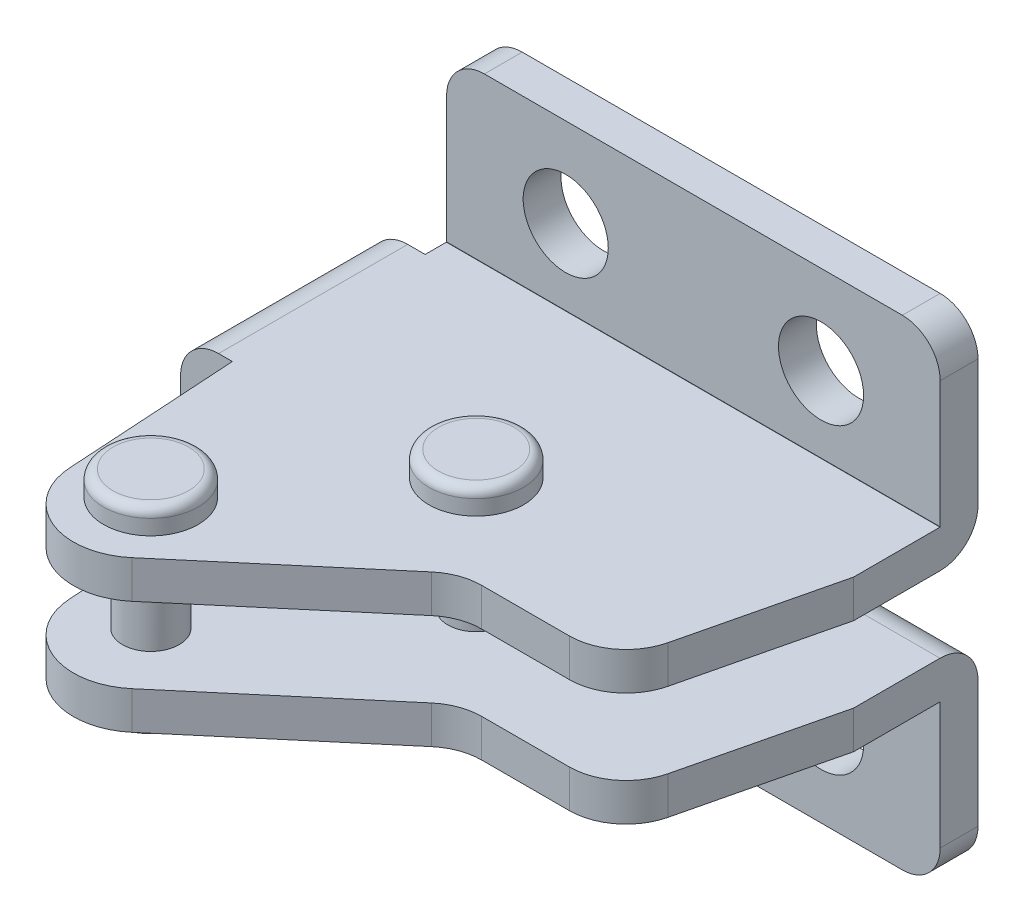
ISO-10303-21;
HEADER;
FILE_DESCRIPTION(('STEP AP214'),'2;1');
FILE_NAME('part.step','',(''),(''),'','','');
FILE_SCHEMA(('AUTOMOTIVE_DESIGN { 1 0 10303 214 1 1 1 1 }'));
ENDSEC;
DATA;
#1=APPLICATION_CONTEXT('core data for automotive mechanical design processes');
#2=APPLICATION_PROTOCOL_DEFINITION('international standard','automotive_design',2000,#1);
#3=PRODUCT_CONTEXT('',#1,'mechanical');
#4=PRODUCT('Part','Part','',(#3));
#5=PRODUCT_RELATED_PRODUCT_CATEGORY('part','',(#4));
#6=PRODUCT_DEFINITION_FORMATION('','',#4);
#7=PRODUCT_DEFINITION_CONTEXT('part definition',#1,'design');
#8=PRODUCT_DEFINITION('design','',#6,#7);
#9=PRODUCT_DEFINITION_SHAPE('','',#8);
#10=(LENGTH_UNIT() NAMED_UNIT(*) SI_UNIT(.MILLI.,.METRE.));
#11=(NAMED_UNIT(*) PLANE_ANGLE_UNIT() SI_UNIT($,.RADIAN.));
#12=(NAMED_UNIT(*) SI_UNIT($,.STERADIAN.) SOLID_ANGLE_UNIT());
#13=UNCERTAINTY_MEASURE_WITH_UNIT(LENGTH_MEASURE(1.E-05),#10,'distance_accuracy_value','');
#14=(GEOMETRIC_REPRESENTATION_CONTEXT(3) GLOBAL_UNCERTAINTY_ASSIGNED_CONTEXT((#13)) GLOBAL_UNIT_ASSIGNED_CONTEXT((#10,
#11,#12)) REPRESENTATION_CONTEXT('',''));
#15=CARTESIAN_POINT('',(0.,0.,0.));
#16=DIRECTION('',(0.,0.,1.));
#17=DIRECTION('',(1.,0.,0.));
#18=AXIS2_PLACEMENT_3D('',#15,#16,#17);
#19=CARTESIAN_POINT('',(-2.43173415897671,13.3,21.5058015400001));
#20=DIRECTION('',(0.,-1.,0.));
#21=DIRECTION('',(0.933181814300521,0.,0.359404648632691));
#22=AXIS2_PLACEMENT_3D('',#19,#20,#21);
#23=PLANE('',#22);
#24=CARTESIAN_POINT('',(-2.43173415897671,13.3,21.5058015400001));
#25=DIRECTION('',(0.,-1.,0.));
#26=DIRECTION('',(0.933181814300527,0.,0.359404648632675));
#27=AXIS2_PLACEMENT_3D('',#24,#25,#26);
#28=CIRCLE('',#27,1.99999999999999);
#29=CARTESIAN_POINT('',(-0.565370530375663,13.3,22.2246108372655));
#30=VERTEX_POINT('',#29);
#31=CARTESIAN_POINT('',(-4.29809778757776,13.3,20.7869922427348));
#32=VERTEX_POINT('',#31);
#33=EDGE_CURVE('E1021',#30,#32,#28,.T.);
#34=ORIENTED_EDGE('',*,*,#33,.F.);
#35=CARTESIAN_POINT('',(-2.43173415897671,13.3,21.5058015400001));
#36=DIRECTION('',(0.,-1.,0.));
#37=DIRECTION('',(-0.933181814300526,0.,-0.359404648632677));
#38=AXIS2_PLACEMENT_3D('',#35,#36,#37);
#39=CIRCLE('',#38,1.99999999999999);
#40=EDGE_CURVE('E999',#32,#30,#39,.T.);
#41=ORIENTED_EDGE('',*,*,#40,.F.);
#42=EDGE_LOOP('',(#34,#41));
#43=FACE_BOUND('',#42,.T.);
#44=ADVANCED_FACE('F16',(#43),#23,.F.);
#45=CARTESIAN_POINT('',(-2.43173415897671,12.8,21.5058015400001));
#46=DIRECTION('',(0.,-1.,0.));
#47=DIRECTION('',(0.933181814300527,0.,0.359404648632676));
#48=AXIS2_PLACEMENT_3D('',#45,#46,#47);
#49=TOROIDAL_SURFACE('',#48,1.99999999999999,0.5);
#50=ORIENTED_EDGE('',*,*,#33,.T.);
#51=ORIENTED_EDGE('',*,*,#40,.T.);
#52=EDGE_LOOP('',(#50,#51));
#53=FACE_BOUND('',#52,.T.);
#54=CARTESIAN_POINT('',(-2.43173415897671,12.8,21.5058015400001));
#55=DIRECTION('',(0.,1.,0.));
#56=DIRECTION('',(-0.933181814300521,0.,-0.359404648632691));
#57=AXIS2_PLACEMENT_3D('',#54,#55,#56);
#58=CIRCLE('',#57,2.5);
#59=CARTESIAN_POINT('',(-4.76468869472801,12.8,20.6072899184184));
#60=VERTEX_POINT('',#59);
#61=EDGE_CURVE('E386',#60,#60,#58,.F.);
#62=ORIENTED_EDGE('',*,*,#61,.F.);
#63=EDGE_LOOP('',(#62));
#64=FACE_BOUND('',#63,.T.);
#65=ADVANCED_FACE('F964',(#53,#64),#49,.T.);
#66=CARTESIAN_POINT('',(-2.43173415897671,12.,21.5058015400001));
#67=DIRECTION('',(0.,1.,0.));
#68=DIRECTION('',(-0.933181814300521,0.,-0.359404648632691));
#69=AXIS2_PLACEMENT_3D('',#66,#67,#68);
#70=CYLINDRICAL_SURFACE('',#69,2.5);
#71=ORIENTED_EDGE('',*,*,#61,.T.);
#72=EDGE_LOOP('',(#71));
#73=FACE_BOUND('',#72,.T.);
#74=CARTESIAN_POINT('',(-2.43173415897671,12.,21.5058015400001));
#75=DIRECTION('',(0.,-1.,0.));
#76=DIRECTION('',(1.,0.,0.));
#77=AXIS2_PLACEMENT_3D('',#74,#75,#76);
#78=CIRCLE('',#77,2.5);
#79=CARTESIAN_POINT('',(0.0682658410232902,12.,21.5058015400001));
#80=VERTEX_POINT('',#79);
#81=EDGE_CURVE('E727',#80,#80,#78,.T.);
#82=ORIENTED_EDGE('',*,*,#81,.F.);
#83=EDGE_LOOP('',(#82));
#84=FACE_BOUND('',#83,.T.);
#85=ADVANCED_FACE('F18',(#73,#84),#70,.T.);
#86=CARTESIAN_POINT('',(5.26820548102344,2.7,12.0000960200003));
#87=DIRECTION('',(0.,1.,0.));
#88=DIRECTION('',(0.882613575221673,0.,0.470099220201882));
#89=AXIS2_PLACEMENT_3D('',#86,#87,#88);
#90=PLANE('',#89);
#91=CARTESIAN_POINT('',(5.26820548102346,2.7,12.0000960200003));
#92=DIRECTION('',(0.,1.,0.));
#93=DIRECTION('',(0.882613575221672,0.,0.470099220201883));
#94=AXIS2_PLACEMENT_3D('',#91,#92,#93);
#95=CIRCLE('',#94,1.99999999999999);
#96=CARTESIAN_POINT('',(7.03343263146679,2.7,12.9402944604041));
#97=VERTEX_POINT('',#96);
#98=CARTESIAN_POINT('',(3.5029783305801,2.7,11.0598975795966));
#99=VERTEX_POINT('',#98);
#100=EDGE_CURVE('E377',#97,#99,#95,.T.);
#101=ORIENTED_EDGE('',*,*,#100,.F.);
#102=CARTESIAN_POINT('',(5.26820548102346,2.7,12.0000960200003));
#103=DIRECTION('',(0.,1.,0.));
#104=DIRECTION('',(-0.882613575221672,0.,-0.470099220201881));
#105=AXIS2_PLACEMENT_3D('',#102,#103,#104);
#106=CIRCLE('',#105,1.99999999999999);
#107=EDGE_CURVE('E314',#99,#97,#106,.T.);
#108=ORIENTED_EDGE('',*,*,#107,.F.);
#109=EDGE_LOOP('',(#101,#108));
#110=FACE_BOUND('',#109,.T.);
#111=ADVANCED_FACE('F343',(#110),#90,.F.);
#112=CARTESIAN_POINT('',(5.26820548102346,3.2,12.0000960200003));
#113=DIRECTION('',(0.,1.,0.));
#114=DIRECTION('',(0.882613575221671,0.,0.470099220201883));
#115=AXIS2_PLACEMENT_3D('',#112,#113,#114);
#116=TOROIDAL_SURFACE('',#115,1.99999999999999,0.5);
#117=ORIENTED_EDGE('',*,*,#100,.T.);
#118=ORIENTED_EDGE('',*,*,#107,.T.);
#119=EDGE_LOOP('',(#117,#118));
#120=FACE_BOUND('',#119,.T.);
#121=CARTESIAN_POINT('',(5.26820548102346,3.2,12.0000960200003));
#122=DIRECTION('',(0.,-1.,0.));
#123=DIRECTION('',(-0.882613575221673,0.,-0.470099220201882));
#124=AXIS2_PLACEMENT_3D('',#121,#122,#123);
#125=CIRCLE('',#124,2.5);
#126=CARTESIAN_POINT('',(3.06167154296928,3.2,10.8248479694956));
#127=VERTEX_POINT('',#126);
#128=EDGE_CURVE('E319',#127,#127,#125,.F.);
#129=ORIENTED_EDGE('',*,*,#128,.F.);
#130=EDGE_LOOP('',(#129));
#131=FACE_BOUND('',#130,.T.);
#132=ADVANCED_FACE('F339',(#120,#131),#116,.T.);
#133=CARTESIAN_POINT('',(5.26820548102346,4.,12.0000960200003));
#134=DIRECTION('',(0.,-1.,0.));
#135=DIRECTION('',(-0.882613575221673,0.,-0.470099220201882));
#136=AXIS2_PLACEMENT_3D('',#133,#134,#135);
#137=CYLINDRICAL_SURFACE('',#136,2.5);
#138=ORIENTED_EDGE('',*,*,#128,.T.);
#139=EDGE_LOOP('',(#138));
#140=FACE_BOUND('',#139,.T.);
#141=CARTESIAN_POINT('',(5.26820548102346,4.00000000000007,12.0000960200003));
#142=DIRECTION('',(0.,1.,0.));
#143=DIRECTION('',(-1.,0.,0.));
#144=AXIS2_PLACEMENT_3D('',#141,#142,#143);
#145=CIRCLE('',#144,2.5);
#146=CARTESIAN_POINT('',(2.76820548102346,4.00000000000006,12.0000960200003));
#147=VERTEX_POINT('',#146);
#148=EDGE_CURVE('E724',#147,#147,#145,.T.);
#149=ORIENTED_EDGE('',*,*,#148,.F.);
#150=EDGE_LOOP('',(#149));
#151=FACE_BOUND('',#150,.T.);
#152=ADVANCED_FACE('F1084',(#140,#151),#137,.T.);
#153=CARTESIAN_POINT('',(14.980875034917,4.00000000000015,13.7899999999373));
#154=DIRECTION('',(0.,1.,0.));
#155=DIRECTION('',(-1.,0.,0.));
#156=AXIS2_PLACEMENT_3D('',#153,#154,#155);
#157=PLANE('',#156);
#158=ORIENTED_EDGE('',*,*,#148,.T.);
#159=EDGE_LOOP('',(#158));
#160=FACE_BOUND('',#159,.T.);
#161=DIRECTION('',(-1.,0.,0.));
#162=VECTOR('',#161,1.);
#163=CARTESIAN_POINT('',(14.9808750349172,4.00000000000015,2.01000000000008));
#164=LINE('',#163,#162);
#165=CARTESIAN_POINT('',(19.8,4.0000000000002,2.01000000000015));
#166=VERTEX_POINT('',#165);
#167=CARTESIAN_POINT('',(-6.3,4.,2.00999999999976));
#168=VERTEX_POINT('',#167);
#169=EDGE_CURVE('E444',#166,#168,#164,.T.);
#170=ORIENTED_EDGE('',*,*,#169,.F.);
#171=DIRECTION('',(0.,0.,1.));
#172=VECTOR('',#171,1.);
#173=CARTESIAN_POINT('',(19.8,4.0000000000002,6.57750204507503));
#174=LINE('',#173,#172);
#175=CARTESIAN_POINT('',(19.8,4.0000000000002,6.57750204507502));
#176=VERTEX_POINT('',#175);
#177=EDGE_CURVE('E414',#166,#176,#174,.T.);
#178=ORIENTED_EDGE('',*,*,#177,.T.);
#179=DIRECTION('',(-0.233713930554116,0.,0.972305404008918));
#180=VECTOR('',#179,1.);
#181=CARTESIAN_POINT('',(19.8,4.0000000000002,6.57750204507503));
#182=LINE('',#181,#180);
#183=CARTESIAN_POINT('',(17.8977912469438,4.00000000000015,14.4911417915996));
#184=VERTEX_POINT('',#183);
#185=EDGE_CURVE('E417',#176,#184,#182,.T.);
#186=ORIENTED_EDGE('',*,*,#185,.T.);
#187=CARTESIAN_POINT('',(14.980875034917,4.00000000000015,13.7899999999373));
#188=DIRECTION('',(0.,-1.,0.));
#189=DIRECTION('',(1.,0.,0.));
#190=AXIS2_PLACEMENT_3D('',#187,#188,#189);
#191=CIRCLE('',#190,3.);
#192=CARTESIAN_POINT('',(14.980875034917,4.00000000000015,16.7899999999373));
#193=VERTEX_POINT('',#192);
#194=EDGE_CURVE('E430',#193,#184,#191,.F.);
#195=ORIENTED_EDGE('',*,*,#194,.F.);
#196=DIRECTION('',(-1.,0.,0.));
#197=VECTOR('',#196,1.);
#198=CARTESIAN_POINT('',(14.980875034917,4.00000000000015,16.7899999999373));
#199=LINE('',#198,#197);
#200=CARTESIAN_POINT('',(10.3472174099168,4.0000000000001,16.7899999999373));
#201=VERTEX_POINT('',#200);
#202=EDGE_CURVE('E433',#193,#201,#199,.T.);
#203=ORIENTED_EDGE('',*,*,#202,.T.);
#204=CARTESIAN_POINT('',(10.3472174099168,4.0000000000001,19.7899999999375));
#205=DIRECTION('',(0.,-1.,0.));
#206=DIRECTION('',(1.,0.,0.));
#207=AXIS2_PLACEMENT_3D('',#204,#205,#206);
#208=CIRCLE('',#207,3.00000000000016);
#209=CARTESIAN_POINT('',(8.40756694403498,4.0000000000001,17.5013855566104));
#210=VERTEX_POINT('',#209);
#211=EDGE_CURVE('E434',#201,#210,#208,.F.);
#212=ORIENTED_EDGE('',*,*,#211,.T.);
#213=DIRECTION('',(-0.762871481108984,0.,0.646550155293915));
#214=VECTOR('',#213,1.);
#215=CARTESIAN_POINT('',(8.40756694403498,4.0000000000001,17.5013855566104));
#216=LINE('',#215,#214);
#217=CARTESIAN_POINT('',(-0.16880861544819,4.00000000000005,24.7700501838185));
#218=VERTEX_POINT('',#217);
#219=EDGE_CURVE('E437',#210,#218,#216,.T.);
#220=ORIENTED_EDGE('',*,*,#219,.T.);
#221=CARTESIAN_POINT('',(-2.43173415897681,4.,22.0999999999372));
#222=DIRECTION('',(0.,-1.,0.));
#223=DIRECTION('',(1.,0.,0.));
#224=AXIS2_PLACEMENT_3D('',#221,#222,#223);
#225=CIRCLE('',#224,3.49999999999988);
#226=CARTESIAN_POINT('',(-5.92504026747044,4.,22.31636180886));
#227=VERTEX_POINT('',#226);
#228=EDGE_CURVE('E443',#227,#218,#225,.F.);
#229=ORIENTED_EDGE('',*,*,#228,.F.);
#230=DIRECTION('',(-0.0618176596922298,0.,-0.998087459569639));
#231=VECTOR('',#230,1.);
#232=CARTESIAN_POINT('',(-6.43568394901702,4.,14.071678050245));
#233=LINE('',#232,#231);
#234=CARTESIAN_POINT('',(-6.49379131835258,4.,13.1334957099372));
#235=VERTEX_POINT('',#234);
#236=EDGE_CURVE('E464',#227,#235,#233,.T.);
#237=ORIENTED_EDGE('',*,*,#236,.T.);
#238=DIRECTION('',(-1.,0.,0.));
#239=VECTOR('',#238,1.);
#240=CARTESIAN_POINT('',(14.980875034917,4.00000000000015,13.1334957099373));
#241=LINE('',#240,#239);
#242=CARTESIAN_POINT('',(-7.22264511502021,4.,13.1334957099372));
#243=VERTEX_POINT('',#242);
#244=EDGE_CURVE('E744',#243,#235,#241,.F.);
#245=ORIENTED_EDGE('',*,*,#244,.F.);
#246=DIRECTION('',(0.,0.,1.));
#247=VECTOR('',#246,1.);
#248=CARTESIAN_POINT('',(-7.22264511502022,4.,13.789999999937));
#249=LINE('',#248,#247);
#250=CARTESIAN_POINT('',(-7.22264511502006,4.,3.13349570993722));
#251=VERTEX_POINT('',#250);
#252=EDGE_CURVE('E448',#251,#243,#249,.T.);
#253=ORIENTED_EDGE('',*,*,#252,.F.);
#254=DIRECTION('',(-1.,0.,0.));
#255=VECTOR('',#254,1.);
#256=CARTESIAN_POINT('',(-7.23264511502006,4.,3.13349570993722));
#257=LINE('',#256,#255);
#258=CARTESIAN_POINT('',(-6.3,4.,3.13349570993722));
#259=VERTEX_POINT('',#258);
#260=EDGE_CURVE('E755',#251,#259,#257,.F.);
#261=ORIENTED_EDGE('',*,*,#260,.T.);
#262=DIRECTION('',(0.,0.,1.));
#263=VECTOR('',#262,1.);
#264=CARTESIAN_POINT('',(-6.3000000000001,4.,13.7899999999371));
#265=LINE('',#264,#263);
#266=EDGE_CURVE('E756',#168,#259,#265,.T.);
#267=ORIENTED_EDGE('',*,*,#266,.F.);
#268=EDGE_LOOP('',(#170,#178,#186,#195,#203,#212,#220,#229,#237,#245,#253,#261,#267));
#269=FACE_BOUND('',#268,.T.);
#270=CARTESIAN_POINT('',(-2.43173415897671,4.,21.5058015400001));
#271=DIRECTION('',(0.,1.,0.));
#272=DIRECTION('',(-1.,0.,0.));
#273=AXIS2_PLACEMENT_3D('',#270,#271,#272);
#274=CIRCLE('',#273,2.5);
#275=CARTESIAN_POINT('',(-4.93173415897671,3.99999999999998,21.5058015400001));
#276=VERTEX_POINT('',#275);
#277=EDGE_CURVE('E733',#276,#276,#274,.T.);
#278=ORIENTED_EDGE('',*,*,#277,.T.);
#279=EDGE_LOOP('',(#278));
#280=FACE_BOUND('',#279,.T.);
#281=ADVANCED_FACE('F850',(#160,#269,#280),#157,.F.);
#282=CARTESIAN_POINT('',(-36.579173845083,12.,13.7899999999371));
#283=DIRECTION('',(0.,-1.,0.));
#284=DIRECTION('',(1.,0.,0.));
#285=AXIS2_PLACEMENT_3D('',#282,#283,#284);
#286=PLANE('',#285);
#287=ORIENTED_EDGE('',*,*,#81,.T.);
#288=EDGE_LOOP('',(#287));
#289=FACE_BOUND('',#288,.T.);
#290=DIRECTION('',(1.,0.,0.));
#291=VECTOR('',#290,1.);
#292=CARTESIAN_POINT('',(-36.5791738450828,12.,2.00999999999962));
#293=LINE('',#292,#291);
#294=CARTESIAN_POINT('',(-6.30000000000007,12.,2.01000000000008));
#295=VERTEX_POINT('',#294);
#296=CARTESIAN_POINT('',(19.8,12.,2.01000000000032));
#297=VERTEX_POINT('',#296);
#298=EDGE_CURVE('E587',#295,#297,#293,.T.);
#299=ORIENTED_EDGE('',*,*,#298,.F.);
#300=DIRECTION('',(0.,0.,1.));
#301=VECTOR('',#300,1.);
#302=CARTESIAN_POINT('',(-6.30000000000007,12.,2.01000000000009));
#303=LINE('',#302,#301);
#304=CARTESIAN_POINT('',(-6.30000000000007,12.,3.13349570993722));
#305=VERTEX_POINT('',#304);
#306=EDGE_CURVE('E772',#295,#305,#303,.T.);
#307=ORIENTED_EDGE('',*,*,#306,.T.);
#308=DIRECTION('',(-1.,0.,0.));
#309=VECTOR('',#308,1.);
#310=CARTESIAN_POINT('',(-36.5791738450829,12.,3.1334957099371));
#311=LINE('',#310,#309);
#312=CARTESIAN_POINT('',(-7.22264511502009,12.,3.13349570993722));
#313=VERTEX_POINT('',#312);
#314=EDGE_CURVE('E24',#313,#305,#311,.F.);
#315=ORIENTED_EDGE('',*,*,#314,.F.);
#316=DIRECTION('',(0.,0.,1.));
#317=VECTOR('',#316,1.);
#318=CARTESIAN_POINT('',(-7.22264511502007,12.,-2.51456770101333));
#319=LINE('',#318,#317);
#320=CARTESIAN_POINT('',(-7.22264511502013,12.,13.1334957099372));
#321=VERTEX_POINT('',#320);
#322=EDGE_CURVE('E545',#321,#313,#319,.F.);
#323=ORIENTED_EDGE('',*,*,#322,.F.);
#324=DIRECTION('',(-1.,0.,0.));
#325=VECTOR('',#324,1.);
#326=CARTESIAN_POINT('',(-7.23264511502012,12.,13.1334957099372));
#327=LINE('',#326,#325);
#328=CARTESIAN_POINT('',(-6.49379131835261,12.,13.1334957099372));
#329=VERTEX_POINT('',#328);
#330=EDGE_CURVE('E737',#321,#329,#327,.F.);
#331=ORIENTED_EDGE('',*,*,#330,.T.);
#332=DIRECTION('',(-0.0618176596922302,0.,-0.998087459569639));
#333=VECTOR('',#332,1.);
#334=CARTESIAN_POINT('',(-6.43568394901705,12.,14.071678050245));
#335=LINE('',#334,#333);
#336=CARTESIAN_POINT('',(-5.92504026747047,12.,22.31636180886));
#337=VERTEX_POINT('',#336);
#338=EDGE_CURVE('E557',#329,#337,#335,.F.);
#339=ORIENTED_EDGE('',*,*,#338,.T.);
#340=CARTESIAN_POINT('',(-2.43173415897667,12.,22.0999999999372));
#341=DIRECTION('',(0.,1.,0.));
#342=DIRECTION('',(-1.,0.,0.));
#343=AXIS2_PLACEMENT_3D('',#340,#341,#342);
#344=CIRCLE('',#343,3.50000000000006);
#345=CARTESIAN_POINT('',(-0.168808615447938,12.,24.7700501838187));
#346=VERTEX_POINT('',#345);
#347=EDGE_CURVE('E563',#346,#337,#344,.F.);
#348=ORIENTED_EDGE('',*,*,#347,.F.);
#349=DIRECTION('',(-0.762871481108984,0.,0.646550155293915));
#350=VECTOR('',#349,1.);
#351=CARTESIAN_POINT('',(8.40756694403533,12.,17.5013855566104));
#352=LINE('',#351,#350);
#353=CARTESIAN_POINT('',(8.40756694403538,12.,17.5013855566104));
#354=VERTEX_POINT('',#353);
#355=EDGE_CURVE('E566',#346,#354,#352,.F.);
#356=ORIENTED_EDGE('',*,*,#355,.T.);
#357=CARTESIAN_POINT('',(10.3472174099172,12.,19.7899999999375));
#358=DIRECTION('',(0.,1.,0.));
#359=DIRECTION('',(-1.,0.,0.));
#360=AXIS2_PLACEMENT_3D('',#357,#358,#359);
#361=CIRCLE('',#360,3.00000000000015);
#362=CARTESIAN_POINT('',(10.3472174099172,12.,16.7899999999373));
#363=VERTEX_POINT('',#362);
#364=EDGE_CURVE('E567',#354,#363,#361,.F.);
#365=ORIENTED_EDGE('',*,*,#364,.T.);
#366=DIRECTION('',(-1.,0.,0.));
#367=VECTOR('',#366,1.);
#368=CARTESIAN_POINT('',(14.980875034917,12.,16.7899999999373));
#369=LINE('',#368,#367);
#370=CARTESIAN_POINT('',(14.980875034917,12.,16.7899999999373));
#371=VERTEX_POINT('',#370);
#372=EDGE_CURVE('E570',#363,#371,#369,.F.);
#373=ORIENTED_EDGE('',*,*,#372,.T.);
#374=CARTESIAN_POINT('',(14.980875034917,12.,13.7899999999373));
#375=DIRECTION('',(0.,1.,0.));
#376=DIRECTION('',(-1.,0.,0.));
#377=AXIS2_PLACEMENT_3D('',#374,#375,#376);
#378=CIRCLE('',#377,3.);
#379=CARTESIAN_POINT('',(17.8977912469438,12.,14.4911417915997));
#380=VERTEX_POINT('',#379);
#381=EDGE_CURVE('E576',#380,#371,#378,.F.);
#382=ORIENTED_EDGE('',*,*,#381,.F.);
#383=DIRECTION('',(-0.233713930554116,0.,0.972305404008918));
#384=VECTOR('',#383,1.);
#385=CARTESIAN_POINT('',(19.8,12.,6.57750204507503));
#386=LINE('',#385,#384);
#387=CARTESIAN_POINT('',(19.8,12.,6.57750204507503));
#388=VERTEX_POINT('',#387);
#389=EDGE_CURVE('E579',#380,#388,#386,.F.);
#390=ORIENTED_EDGE('',*,*,#389,.T.);
#391=DIRECTION('',(0.,0.,1.));
#392=VECTOR('',#391,1.);
#393=CARTESIAN_POINT('',(19.8,12.,6.57750204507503));
#394=LINE('',#393,#392);
#395=EDGE_CURVE('E580',#388,#297,#394,.F.);
#396=ORIENTED_EDGE('',*,*,#395,.T.);
#397=EDGE_LOOP('',(#299,#307,#315,#323,#331,#339,#348,#356,#365,#373,#382,#390,#396));
#398=FACE_BOUND('',#397,.T.);
#399=CARTESIAN_POINT('',(5.26820548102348,12.,12.0000960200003));
#400=DIRECTION('',(0.,-1.,0.));
#401=DIRECTION('',(1.,0.,0.));
#402=AXIS2_PLACEMENT_3D('',#399,#400,#401);
#403=CIRCLE('',#402,2.5);
#404=CARTESIAN_POINT('',(7.76820548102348,12.,12.0000960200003));
#405=VERTEX_POINT('',#404);
#406=EDGE_CURVE('E730',#405,#405,#403,.T.);
#407=ORIENTED_EDGE('',*,*,#406,.T.);
#408=EDGE_LOOP('',(#407));
#409=FACE_BOUND('',#408,.T.);
#410=ADVANCED_FACE('F779',(#289,#398,#409),#286,.F.);
#411=CARTESIAN_POINT('',(5.26820548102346,4.,12.0000960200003));
#412=DIRECTION('',(0.,1.,0.));
#413=DIRECTION('',(0.882613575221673,0.,0.470099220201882));
#414=AXIS2_PLACEMENT_3D('',#411,#412,#413);
#415=CYLINDRICAL_SURFACE('',#414,1.5);
#416=CARTESIAN_POINT('',(5.26820548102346,6.00000000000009,12.0000960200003));
#417=DIRECTION('',(0.,1.,0.));
#418=DIRECTION('',(-1.,0.,6.93590386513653E-12));
#419=AXIS2_PLACEMENT_3D('',#416,#417,#418);
#420=CIRCLE('',#419,1.5);
#421=CARTESIAN_POINT('',(3.76820548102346,6.00000000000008,12.0000960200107));
#422=VERTEX_POINT('',#421);
#423=EDGE_CURVE('E734',#422,#422,#420,.F.);
#424=ORIENTED_EDGE('',*,*,#423,.F.);
#425=EDGE_LOOP('',(#424));
#426=FACE_BOUND('',#425,.T.);
#427=CARTESIAN_POINT('',(5.26820548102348,10.,12.0000960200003));
#428=DIRECTION('',(0.,-1.,0.));
#429=DIRECTION('',(1.,0.,-6.93590386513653E-12));
#430=AXIS2_PLACEMENT_3D('',#427,#428,#429);
#431=CIRCLE('',#430,1.5);
#432=CARTESIAN_POINT('',(6.76820548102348,10.,12.0000960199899));
#433=VERTEX_POINT('',#432);
#434=EDGE_CURVE('E1100',#433,#433,#431,.F.);
#435=ORIENTED_EDGE('',*,*,#434,.F.);
#436=EDGE_LOOP('',(#435));
#437=FACE_BOUND('',#436,.T.);
#438=ADVANCED_FACE('F338',(#426,#437),#415,.T.);
#439=CARTESIAN_POINT('',(0.,0.,2.));
#440=DIRECTION('',(0.,0.,1.));
#441=DIRECTION('',(1.,0.,0.));
#442=AXIS2_PLACEMENT_3D('',#439,#440,#441);
#443=CYLINDRICAL_SURFACE('',#442,2.25);
#444=CARTESIAN_POINT('',(0.,0.,0.));
#445=DIRECTION('',(0.,0.,1.));
#446=DIRECTION('',(1.,0.,0.));
#447=AXIS2_PLACEMENT_3D('',#444,#445,#446);
#448=CIRCLE('',#447,2.25);
#449=CARTESIAN_POINT('',(2.25,0.,0.));
#450=VERTEX_POINT('',#449);
#451=EDGE_CURVE('E663',#450,#450,#448,.T.);
#452=ORIENTED_EDGE('',*,*,#451,.F.);
#453=EDGE_LOOP('',(#452));
#454=FACE_BOUND('',#453,.T.);
#455=CARTESIAN_POINT('',(0.,0.,2.));
#456=DIRECTION('',(0.,0.,1.));
#457=DIRECTION('',(1.,0.,0.));
#458=AXIS2_PLACEMENT_3D('',#455,#456,#457);
#459=CIRCLE('',#458,2.25);
#460=CARTESIAN_POINT('',(2.24999999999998,0.,2.00000000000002));
#461=VERTEX_POINT('',#460);
#462=EDGE_CURVE('E681',#461,#461,#459,.F.);
#463=ORIENTED_EDGE('',*,*,#462,.F.);
#464=EDGE_LOOP('',(#463));
#465=FACE_BOUND('',#464,.T.);
#466=ADVANCED_FACE('F1134',(#454,#465),#443,.F.);
#467=CARTESIAN_POINT('',(13.5,0.,2.00000000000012));
#468=DIRECTION('',(0.,0.,1.));
#469=DIRECTION('',(1.,0.,0.));
#470=AXIS2_PLACEMENT_3D('',#467,#468,#469);
#471=CYLINDRICAL_SURFACE('',#470,2.25);
#472=CARTESIAN_POINT('',(13.5,0.,1.14925430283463E-13));
#473=DIRECTION('',(0.,0.,1.));
#474=DIRECTION('',(1.,0.,0.));
#475=AXIS2_PLACEMENT_3D('',#472,#473,#474);
#476=CIRCLE('',#475,2.25);
#477=CARTESIAN_POINT('',(15.75,1.12677314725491E-13,1.33150277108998E-13));
#478=VERTEX_POINT('',#477);
#479=EDGE_CURVE('E480',#478,#478,#476,.T.);
#480=ORIENTED_EDGE('',*,*,#479,.F.);
#481=EDGE_LOOP('',(#480));
#482=FACE_BOUND('',#481,.T.);
#483=CARTESIAN_POINT('',(13.5,0.,2.00000000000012));
#484=DIRECTION('',(0.,0.,1.));
#485=DIRECTION('',(1.,0.,0.));
#486=AXIS2_PLACEMENT_3D('',#483,#484,#485);
#487=CIRCLE('',#486,2.25);
#488=CARTESIAN_POINT('',(15.75,1.12677314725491E-13,2.00000000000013));
#489=VERTEX_POINT('',#488);
#490=EDGE_CURVE('E552',#489,#489,#487,.F.);
#491=ORIENTED_EDGE('',*,*,#490,.F.);
#492=EDGE_LOOP('',(#491));
#493=FACE_BOUND('',#492,.T.);
#494=ADVANCED_FACE('F1140',(#482,#493),#471,.F.);
#495=CARTESIAN_POINT('',(17.8,-4.6999999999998,1.60461921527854E-13));
#496=DIRECTION('',(0.,1.,0.));
#497=DIRECTION('',(-1.,0.,0.));
#498=AXIS2_PLACEMENT_3D('',#495,#496,#497);
#499=PLANE('',#498);
#500=DIRECTION('',(0.,0.,1.));
#501=VECTOR('',#500,1.);
#502=CARTESIAN_POINT('',(-4.3,-4.6999999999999,0.));
#503=LINE('',#502,#501);
#504=CARTESIAN_POINT('',(-4.3,-4.6999999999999,0.));
#505=VERTEX_POINT('',#504);
#506=CARTESIAN_POINT('',(-4.3,-4.6999999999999,2.));
#507=VERTEX_POINT('',#506);
#508=EDGE_CURVE('E488',#505,#507,#503,.T.);
#509=ORIENTED_EDGE('',*,*,#508,.F.);
#510=DIRECTION('',(-1.,0.,0.));
#511=VECTOR('',#510,1.);
#512=CARTESIAN_POINT('',(14.9808750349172,-4.69999999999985,1.38561037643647E-13));
#513=LINE('',#512,#511);
#514=CARTESIAN_POINT('',(17.8,-4.6999999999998,1.60461921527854E-13));
#515=VERTEX_POINT('',#514);
#516=EDGE_CURVE('E469',#515,#505,#513,.T.);
#517=ORIENTED_EDGE('',*,*,#516,.F.);
#518=DIRECTION('',(0.,0.,1.));
#519=VECTOR('',#518,1.);
#520=CARTESIAN_POINT('',(17.8,-4.6999999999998,1.60461921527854E-13));
#521=LINE('',#520,#519);
#522=CARTESIAN_POINT('',(17.8,-4.6999999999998,2.00000000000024));
#523=VERTEX_POINT('',#522);
#524=EDGE_CURVE('E493',#523,#515,#521,.F.);
#525=ORIENTED_EDGE('',*,*,#524,.F.);
#526=DIRECTION('',(-1.,0.,0.));
#527=VECTOR('',#526,1.);
#528=CARTESIAN_POINT('',(17.8,-4.6999999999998,2.00000000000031));
#529=LINE('',#528,#527);
#530=EDGE_CURVE('E495',#507,#523,#529,.F.);
#531=ORIENTED_EDGE('',*,*,#530,.F.);
#532=EDGE_LOOP('',(#509,#517,#525,#531));
#533=FACE_BOUND('',#532,.T.);
#534=ADVANCED_FACE('F942',(#533),#499,.F.);
#535=CARTESIAN_POINT('',(-4.3,-2.69999999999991,0.));
#536=DIRECTION('',(0.,0.,1.));
#537=DIRECTION('',(1.,0.,0.));
#538=AXIS2_PLACEMENT_3D('',#535,#536,#537);
#539=CYLINDRICAL_SURFACE('',#538,2.);
#540=CARTESIAN_POINT('',(-4.3,-2.69999999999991,0.));
#541=DIRECTION('',(0.,0.,1.));
#542=DIRECTION('',(1.,0.,0.));
#543=AXIS2_PLACEMENT_3D('',#540,#541,#542);
#544=CIRCLE('',#543,2.);
#545=CARTESIAN_POINT('',(-6.3,-2.69999999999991,0.));
#546=VERTEX_POINT('',#545);
#547=EDGE_CURVE('E472',#505,#546,#544,.F.);
#548=ORIENTED_EDGE('',*,*,#547,.F.);
#549=ORIENTED_EDGE('',*,*,#508,.T.);
#550=CARTESIAN_POINT('',(-4.3,-2.69999999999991,1.99999999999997));
#551=DIRECTION('',(0.,0.,1.));
#552=DIRECTION('',(1.,0.,0.));
#553=AXIS2_PLACEMENT_3D('',#550,#551,#552);
#554=CIRCLE('',#553,2.);
#555=CARTESIAN_POINT('',(-6.3,-2.69999999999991,1.99999999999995));
#556=VERTEX_POINT('',#555);
#557=EDGE_CURVE('E489',#507,#556,#554,.F.);
#558=ORIENTED_EDGE('',*,*,#557,.T.);
#559=DIRECTION('',(0.,0.,1.));
#560=VECTOR('',#559,1.);
#561=CARTESIAN_POINT('',(-6.3,-2.69999999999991,0.));
#562=LINE('',#561,#560);
#563=EDGE_CURVE('E485',#556,#546,#562,.F.);
#564=ORIENTED_EDGE('',*,*,#563,.T.);
#565=EDGE_LOOP('',(#548,#549,#558,#564));
#566=FACE_BOUND('',#565,.T.);
#567=ADVANCED_FACE('F935',(#566),#539,.T.);
#568=CARTESIAN_POINT('',(-1.40512601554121E-13,16.,1.99999999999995));
#569=DIRECTION('',(0.,0.,1.));
#570=DIRECTION('',(1.,0.,0.));
#571=AXIS2_PLACEMENT_3D('',#568,#569,#570);
#572=CYLINDRICAL_SURFACE('',#571,2.25);
#573=CARTESIAN_POINT('',(-1.21430643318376E-13,16.,1.09504419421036E-13));
#574=DIRECTION('',(0.,0.,1.));
#575=DIRECTION('',(1.,0.,0.));
#576=AXIS2_PLACEMENT_3D('',#573,#574,#575);
#577=CIRCLE('',#576,2.25);
#578=CARTESIAN_POINT('',(2.24999999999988,16.,1.27729266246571E-13));
#579=VERTEX_POINT('',#578);
#580=EDGE_CURVE('E710',#579,#579,#577,.T.);
#581=ORIENTED_EDGE('',*,*,#580,.F.);
#582=EDGE_LOOP('',(#581));
#583=FACE_BOUND('',#582,.T.);
#584=CARTESIAN_POINT('',(-1.40512601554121E-13,16.,1.99999999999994));
#585=DIRECTION('',(0.,0.,1.));
#586=DIRECTION('',(1.,0.,0.));
#587=AXIS2_PLACEMENT_3D('',#584,#585,#586);
#588=CIRCLE('',#587,2.25);
#589=CARTESIAN_POINT('',(2.24999999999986,16.,1.99999999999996));
#590=VERTEX_POINT('',#589);
#591=EDGE_CURVE('E721',#590,#590,#588,.F.);
#592=ORIENTED_EDGE('',*,*,#591,.F.);
#593=EDGE_LOOP('',(#592));
#594=FACE_BOUND('',#593,.T.);
#595=ADVANCED_FACE('F1146',(#583,#594),#572,.F.);
#596=CARTESIAN_POINT('',(13.4999999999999,16.,2.00000000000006));
#597=DIRECTION('',(0.,0.,1.));
#598=DIRECTION('',(1.,0.,0.));
#599=AXIS2_PLACEMENT_3D('',#596,#597,#598);
#600=CYLINDRICAL_SURFACE('',#599,2.25);
#601=CARTESIAN_POINT('',(13.5,16.,1.59811400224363E-13));
#602=DIRECTION('',(0.,0.,1.));
#603=DIRECTION('',(1.,0.,0.));
#604=AXIS2_PLACEMENT_3D('',#601,#602,#603);
#605=CIRCLE('',#604,2.25);
#606=CARTESIAN_POINT('',(15.75,16.,1.78036247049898E-13));
#607=VERTEX_POINT('',#606);
#608=EDGE_CURVE('E618',#607,#607,#605,.T.);
#609=ORIENTED_EDGE('',*,*,#608,.F.);
#610=EDGE_LOOP('',(#609));
#611=FACE_BOUND('',#610,.T.);
#612=CARTESIAN_POINT('',(13.4999999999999,16.,2.00000000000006));
#613=DIRECTION('',(0.,0.,1.));
#614=DIRECTION('',(1.,0.,0.));
#615=AXIS2_PLACEMENT_3D('',#612,#613,#614);
#616=CIRCLE('',#615,2.25);
#617=CARTESIAN_POINT('',(15.7499999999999,16.,2.00000000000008));
#618=VERTEX_POINT('',#617);
#619=EDGE_CURVE('E640',#618,#618,#616,.F.);
#620=ORIENTED_EDGE('',*,*,#619,.F.);
#621=EDGE_LOOP('',(#620));
#622=FACE_BOUND('',#621,.T.);
#623=ADVANCED_FACE('F1155',(#611,#622),#600,.F.);
#624=CARTESIAN_POINT('',(-4.30000000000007,20.7,1.08853898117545E-13));
#625=DIRECTION('',(0.,-1.,0.));
#626=DIRECTION('',(1.,0.,0.));
#627=AXIS2_PLACEMENT_3D('',#624,#625,#626);
#628=PLANE('',#627);
#629=DIRECTION('',(0.,0.,1.));
#630=VECTOR('',#629,1.);
#631=CARTESIAN_POINT('',(17.8,20.7,1.95373231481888E-13));
#632=LINE('',#631,#630);
#633=CARTESIAN_POINT('',(17.8,20.7,1.95373231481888E-13));
#634=VERTEX_POINT('',#633);
#635=CARTESIAN_POINT('',(17.8,20.7,2.0000000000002));
#636=VERTEX_POINT('',#635);
#637=EDGE_CURVE('E626',#634,#636,#632,.T.);
#638=ORIENTED_EDGE('',*,*,#637,.F.);
#639=DIRECTION('',(-1.,0.,0.));
#640=VECTOR('',#639,1.);
#641=CARTESIAN_POINT('',(-36.5791738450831,20.7,0.));
#642=LINE('',#641,#640);
#643=CARTESIAN_POINT('',(-4.30000000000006,20.7,1.08853898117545E-13));
#644=VERTEX_POINT('',#643);
#645=EDGE_CURVE('E608',#644,#634,#642,.F.);
#646=ORIENTED_EDGE('',*,*,#645,.F.);
#647=DIRECTION('',(0.,0.,1.));
#648=VECTOR('',#647,1.);
#649=CARTESIAN_POINT('',(-4.30000000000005,20.7,1.08853898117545E-13));
#650=LINE('',#649,#648);
#651=CARTESIAN_POINT('',(-4.30000000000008,20.7,2.));
#652=VERTEX_POINT('',#651);
#653=EDGE_CURVE('E630',#652,#644,#650,.F.);
#654=ORIENTED_EDGE('',*,*,#653,.F.);
#655=DIRECTION('',(1.,0.,0.));
#656=VECTOR('',#655,1.);
#657=CARTESIAN_POINT('',(-4.3000000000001,20.7,1.99999999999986));
#658=LINE('',#657,#656);
#659=EDGE_CURVE('E632',#636,#652,#658,.F.);
#660=ORIENTED_EDGE('',*,*,#659,.F.);
#661=EDGE_LOOP('',(#638,#646,#654,#660));
#662=FACE_BOUND('',#661,.T.);
#663=ADVANCED_FACE('F804',(#662),#628,.F.);
#664=CARTESIAN_POINT('',(-4.30000000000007,18.7,1.03866568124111E-13));
#665=DIRECTION('',(0.,0.,1.));
#666=DIRECTION('',(1.,0.,0.));
#667=AXIS2_PLACEMENT_3D('',#664,#665,#666);
#668=CYLINDRICAL_SURFACE('',#667,2.);
#669=CARTESIAN_POINT('',(-4.30000000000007,18.7,1.03866568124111E-13));
#670=DIRECTION('',(0.,0.,1.));
#671=DIRECTION('',(1.,0.,0.));
#672=AXIS2_PLACEMENT_3D('',#669,#670,#671);
#673=CIRCLE('',#672,2.);
#674=CARTESIAN_POINT('',(-6.30000000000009,18.7,0.));
#675=VERTEX_POINT('',#674);
#676=EDGE_CURVE('E612',#675,#644,#673,.F.);
#677=ORIENTED_EDGE('',*,*,#676,.F.);
#678=DIRECTION('',(0.,0.,1.));
#679=VECTOR('',#678,1.);
#680=CARTESIAN_POINT('',(-6.30000000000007,18.7,1.00830802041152E-13));
#681=LINE('',#680,#679);
#682=CARTESIAN_POINT('',(-6.30000000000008,18.7,2.0000000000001));
#683=VERTEX_POINT('',#682);
#684=EDGE_CURVE('E633',#675,#683,#681,.T.);
#685=ORIENTED_EDGE('',*,*,#684,.T.);
#686=CARTESIAN_POINT('',(-4.30000000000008,18.7,2.0000000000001));
#687=DIRECTION('',(0.,0.,1.));
#688=DIRECTION('',(1.,0.,0.));
#689=AXIS2_PLACEMENT_3D('',#686,#687,#688);
#690=CIRCLE('',#689,2.);
#691=EDGE_CURVE('E636',#683,#652,#690,.F.);
#692=ORIENTED_EDGE('',*,*,#691,.T.);
#693=ORIENTED_EDGE('',*,*,#653,.T.);
#694=EDGE_LOOP('',(#677,#685,#692,#693));
#695=FACE_BOUND('',#694,.T.);
#696=ADVANCED_FACE('F808',(#695),#668,.T.);
#697=CARTESIAN_POINT('',(-9.23264511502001,-17.78002444,13.7899999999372));
#698=DIRECTION('',(1.,0.,0.));
#699=DIRECTION('',(0.,0.,-1.));
#700=AXIS2_PLACEMENT_3D('',#697,#698,#699);
#701=PLANE('',#700);
#702=DIRECTION('',(0.,0.,-1.));
#703=VECTOR('',#702,1.);
#704=CARTESIAN_POINT('',(-9.23264511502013,9.99,13.7899999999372));
#705=LINE('',#704,#703);
#706=CARTESIAN_POINT('',(-9.23264511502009,9.99,3.1334957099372));
#707=VERTEX_POINT('',#706);
#708=CARTESIAN_POINT('',(-9.23264511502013,9.99,13.1334957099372));
#709=VERTEX_POINT('',#708);
#710=EDGE_CURVE('E506',#707,#709,#705,.F.);
#711=ORIENTED_EDGE('',*,*,#710,.F.);
#712=DIRECTION('',(0.,1.,0.));
#713=VECTOR('',#712,1.);
#714=CARTESIAN_POINT('',(-9.23264511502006,5.5008505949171,3.1334957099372));
#715=LINE('',#714,#713);
#716=CARTESIAN_POINT('',(-9.23264511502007,6.01,3.1334957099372));
#717=VERTEX_POINT('',#716);
#718=EDGE_CURVE('E499',#707,#717,#715,.F.);
#719=ORIENTED_EDGE('',*,*,#718,.T.);
#720=DIRECTION('',(0.,0.,-1.));
#721=VECTOR('',#720,1.);
#722=CARTESIAN_POINT('',(-9.23264511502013,6.01,18.7815591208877));
#723=LINE('',#722,#721);
#724=CARTESIAN_POINT('',(-9.23264511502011,6.01,13.1334957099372));
#725=VERTEX_POINT('',#724);
#726=EDGE_CURVE('E483',#725,#717,#723,.T.);
#727=ORIENTED_EDGE('',*,*,#726,.F.);
#728=DIRECTION('',(0.,1.,0.));
#729=VECTOR('',#728,1.);
#730=CARTESIAN_POINT('',(-9.2326451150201,4.6346220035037,13.1334957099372));
#731=LINE('',#730,#729);
#732=EDGE_CURVE('E505',#725,#709,#731,.T.);
#733=ORIENTED_EDGE('',*,*,#732,.T.);
#734=EDGE_LOOP('',(#711,#719,#727,#733));
#735=FACE_BOUND('',#734,.T.);
#736=ADVANCED_FACE('F858',(#735),#701,.F.);
#737=CARTESIAN_POINT('',(-6.3,3.99,2.00999999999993));
#738=DIRECTION('',(-1.,0.,0.));
#739=DIRECTION('',(0.,0.,1.));
#740=AXIS2_PLACEMENT_3D('',#737,#738,#739);
#741=PLANE('',#740);
#742=CARTESIAN_POINT('',(-6.3,3.99,2.00999999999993));
#743=DIRECTION('',(1.,0.,0.));
#744=DIRECTION('',(0.,0.,-1.));
#745=AXIS2_PLACEMENT_3D('',#742,#743,#744);
#746=CIRCLE('',#745,2.01);
#747=CARTESIAN_POINT('',(-6.3,6.,2.00999999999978));
#748=VERTEX_POINT('',#747);
#749=CARTESIAN_POINT('',(-6.3,3.99,0.));
#750=VERTEX_POINT('',#749);
#751=EDGE_CURVE('E492',#748,#750,#746,.F.);
#752=ORIENTED_EDGE('',*,*,#751,.T.);
#753=DIRECTION('',(0.,1.,0.));
#754=VECTOR('',#753,1.);
#755=CARTESIAN_POINT('',(-6.30000000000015,17.35650429,-1.14274908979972E-13));
#756=LINE('',#755,#754);
#757=EDGE_CURVE('E477',#546,#750,#756,.T.);
#758=ORIENTED_EDGE('',*,*,#757,.F.);
#759=ORIENTED_EDGE('',*,*,#563,.F.);
#760=DIRECTION('',(0.,1.,0.));
#761=VECTOR('',#760,1.);
#762=CARTESIAN_POINT('',(-6.3,4.7000000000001,1.99999999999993));
#763=LINE('',#762,#761);
#764=CARTESIAN_POINT('',(-6.3,3.99,1.99999999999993));
#765=VERTEX_POINT('',#764);
#766=EDGE_CURVE('E550',#765,#556,#763,.F.);
#767=ORIENTED_EDGE('',*,*,#766,.F.);
#768=CARTESIAN_POINT('',(-6.3,3.99,2.00999999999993));
#769=DIRECTION('',(-1.,0.,0.));
#770=DIRECTION('',(0.,0.,1.));
#771=AXIS2_PLACEMENT_3D('',#768,#769,#770);
#772=CIRCLE('',#771,0.00999999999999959);
#773=EDGE_CURVE('E669',#765,#168,#772,.F.);
#774=ORIENTED_EDGE('',*,*,#773,.T.);
#775=ORIENTED_EDGE('',*,*,#266,.T.);
#776=DIRECTION('',(0.,-1.,0.));
#777=VECTOR('',#776,1.);
#778=CARTESIAN_POINT('',(-6.3,5.50085059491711,3.13349570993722));
#779=LINE('',#778,#777);
#780=CARTESIAN_POINT('',(-6.3,6.,3.13349570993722));
#781=VERTEX_POINT('',#780);
#782=EDGE_CURVE('E765',#259,#781,#779,.F.);
#783=ORIENTED_EDGE('',*,*,#782,.T.);
#784=DIRECTION('',(0.,0.,-1.));
#785=VECTOR('',#784,1.);
#786=CARTESIAN_POINT('',(-6.3,6.,2.00999999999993));
#787=LINE('',#786,#785);
#788=EDGE_CURVE('E759',#748,#781,#787,.F.);
#789=ORIENTED_EDGE('',*,*,#788,.F.);
#790=EDGE_LOOP('',(#752,#758,#759,#767,#774,#775,#783,#789));
#791=FACE_BOUND('',#790,.T.);
#792=ADVANCED_FACE('F843',(#791),#741,.T.);
#793=CARTESIAN_POINT('',(14.980875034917,17.3565042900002,0.));
#794=DIRECTION('',(0.,0.,-1.));
#795=DIRECTION('',(-1.,0.,0.));
#796=AXIS2_PLACEMENT_3D('',#793,#794,#795);
#797=PLANE('',#796);
#798=ORIENTED_EDGE('',*,*,#516,.T.);
#799=ORIENTED_EDGE('',*,*,#547,.T.);
#800=ORIENTED_EDGE('',*,*,#757,.T.);
#801=DIRECTION('',(1.,0.,0.));
#802=VECTOR('',#801,1.);
#803=CARTESIAN_POINT('',(-19.6758918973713,3.9899999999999,-1.75423911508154E-13));
#804=LINE('',#803,#802);
#805=CARTESIAN_POINT('',(19.8,3.9900000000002,1.43765208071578E-13));
#806=VERTEX_POINT('',#805);
#807=EDGE_CURVE('E447',#806,#750,#804,.F.);
#808=ORIENTED_EDGE('',*,*,#807,.F.);
#809=DIRECTION('',(0.,1.,0.));
#810=VECTOR('',#809,1.);
#811=CARTESIAN_POINT('',(19.8,17.3565042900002,0.));
#812=LINE('',#811,#810);
#813=CARTESIAN_POINT('',(19.8,-2.6999999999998,1.68701858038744E-13));
#814=VERTEX_POINT('',#813);
#815=EDGE_CURVE('E474',#806,#814,#812,.F.);
#816=ORIENTED_EDGE('',*,*,#815,.T.);
#817=CARTESIAN_POINT('',(17.8,-2.6999999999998,1.55474591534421E-13));
#818=DIRECTION('',(0.,0.,1.));
#819=DIRECTION('',(1.,0.,0.));
#820=AXIS2_PLACEMENT_3D('',#817,#818,#819);
#821=CIRCLE('',#820,2.);
#822=EDGE_CURVE('E473',#814,#515,#821,.F.);
#823=ORIENTED_EDGE('',*,*,#822,.T.);
#824=EDGE_LOOP('',(#798,#799,#800,#808,#816,#823));
#825=FACE_BOUND('',#824,.T.);
#826=ORIENTED_EDGE('',*,*,#479,.T.);
#827=EDGE_LOOP('',(#826));
#828=FACE_BOUND('',#827,.T.);
#829=ORIENTED_EDGE('',*,*,#451,.T.);
#830=EDGE_LOOP('',(#829));
#831=FACE_BOUND('',#830,.T.);
#832=ADVANCED_FACE('F930',(#825,#828,#831),#797,.T.);
#833=CARTESIAN_POINT('',(17.8,-2.6999999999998,1.55474591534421E-13));
#834=DIRECTION('',(0.,0.,1.));
#835=DIRECTION('',(1.,0.,0.));
#836=AXIS2_PLACEMENT_3D('',#833,#834,#835);
#837=CYLINDRICAL_SURFACE('',#836,2.);
#838=ORIENTED_EDGE('',*,*,#822,.F.);
#839=DIRECTION('',(0.,0.,1.));
#840=VECTOR('',#839,1.);
#841=CARTESIAN_POINT('',(19.8,-2.6999999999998,1.23599047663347E-13));
#842=LINE('',#841,#840);
#843=CARTESIAN_POINT('',(19.8,-2.6999999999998,2.00000000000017));
#844=VERTEX_POINT('',#843);
#845=EDGE_CURVE('E484',#814,#844,#842,.T.);
#846=ORIENTED_EDGE('',*,*,#845,.T.);
#847=CARTESIAN_POINT('',(17.8,-2.6999999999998,2.00000000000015));
#848=DIRECTION('',(0.,0.,1.));
#849=DIRECTION('',(1.,0.,0.));
#850=AXIS2_PLACEMENT_3D('',#847,#848,#849);
#851=CIRCLE('',#850,2.);
#852=EDGE_CURVE('E496',#844,#523,#851,.F.);
#853=ORIENTED_EDGE('',*,*,#852,.T.);
#854=ORIENTED_EDGE('',*,*,#524,.T.);
#855=EDGE_LOOP('',(#838,#846,#853,#854));
#856=FACE_BOUND('',#855,.T.);
#857=ADVANCED_FACE('F946',(#856),#837,.T.);
#858=CARTESIAN_POINT('',(14.9808750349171,17.3565042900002,2.00000000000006));
#859=DIRECTION('',(0.,0.,-1.));
#860=DIRECTION('',(-1.,0.,0.));
#861=AXIS2_PLACEMENT_3D('',#858,#859,#860);
#862=PLANE('',#861);
#863=ORIENTED_EDGE('',*,*,#766,.T.);
#864=ORIENTED_EDGE('',*,*,#557,.F.);
#865=ORIENTED_EDGE('',*,*,#530,.T.);
#866=ORIENTED_EDGE('',*,*,#852,.F.);
#867=DIRECTION('',(0.,1.,0.));
#868=VECTOR('',#867,1.);
#869=CARTESIAN_POINT('',(19.8,10.1440063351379,2.00000000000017));
#870=LINE('',#869,#868);
#871=CARTESIAN_POINT('',(19.8,3.9900000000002,2.00000000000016));
#872=VERTEX_POINT('',#871);
#873=EDGE_CURVE('E481',#844,#872,#870,.T.);
#874=ORIENTED_EDGE('',*,*,#873,.T.);
#875=DIRECTION('',(-1.,0.,0.));
#876=VECTOR('',#875,1.);
#877=CARTESIAN_POINT('',(14.9808750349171,3.99000000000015,2.00000000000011));
#878=LINE('',#877,#876);
#879=EDGE_CURVE('E666',#872,#765,#878,.T.);
#880=ORIENTED_EDGE('',*,*,#879,.T.);
#881=EDGE_LOOP('',(#863,#864,#865,#866,#874,#880));
#882=FACE_BOUND('',#881,.T.);
#883=ORIENTED_EDGE('',*,*,#490,.T.);
#884=EDGE_LOOP('',(#883));
#885=FACE_BOUND('',#884,.T.);
#886=ORIENTED_EDGE('',*,*,#462,.T.);
#887=EDGE_LOOP('',(#886));
#888=FACE_BOUND('',#887,.T.);
#889=ADVANCED_FACE('F938',(#882,#885,#888),#862,.F.);
#890=CARTESIAN_POINT('',(-36.579173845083,-1.35650429,1.99999999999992));
#891=DIRECTION('',(0.,0.,-1.));
#892=DIRECTION('',(-1.,0.,0.));
#893=AXIS2_PLACEMENT_3D('',#890,#891,#892);
#894=PLANE('',#893);
#895=DIRECTION('',(0.,1.,0.));
#896=VECTOR('',#895,1.);
#897=CARTESIAN_POINT('',(19.8,5.85599366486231,2.00000000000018));
#898=LINE('',#897,#896);
#899=CARTESIAN_POINT('',(19.8,12.01,2.00000000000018));
#900=VERTEX_POINT('',#899);
#901=CARTESIAN_POINT('',(19.8,18.7,2.00000000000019));
#902=VERTEX_POINT('',#901);
#903=EDGE_CURVE('E623',#900,#902,#898,.T.);
#904=ORIENTED_EDGE('',*,*,#903,.T.);
#905=CARTESIAN_POINT('',(17.8,18.7,2.00000000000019));
#906=DIRECTION('',(0.,0.,1.));
#907=DIRECTION('',(1.,0.,0.));
#908=AXIS2_PLACEMENT_3D('',#905,#906,#907);
#909=CIRCLE('',#908,2.);
#910=EDGE_CURVE('E629',#636,#902,#909,.F.);
#911=ORIENTED_EDGE('',*,*,#910,.F.);
#912=ORIENTED_EDGE('',*,*,#659,.T.);
#913=ORIENTED_EDGE('',*,*,#691,.F.);
#914=DIRECTION('',(0.,1.,0.));
#915=VECTOR('',#914,1.);
#916=CARTESIAN_POINT('',(-6.30000000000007,11.3,2.0000000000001));
#917=LINE('',#916,#915);
#918=CARTESIAN_POINT('',(-6.30000000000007,12.01,2.00000000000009));
#919=VERTEX_POINT('',#918);
#920=EDGE_CURVE('E638',#683,#919,#917,.F.);
#921=ORIENTED_EDGE('',*,*,#920,.T.);
#922=DIRECTION('',(-1.,0.,0.));
#923=VECTOR('',#922,1.);
#924=CARTESIAN_POINT('',(33.1758918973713,12.01,2.00000000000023));
#925=LINE('',#924,#923);
#926=EDGE_CURVE('E619',#919,#900,#925,.F.);
#927=ORIENTED_EDGE('',*,*,#926,.T.);
#928=EDGE_LOOP('',(#904,#911,#912,#913,#921,#927));
#929=FACE_BOUND('',#928,.T.);
#930=ORIENTED_EDGE('',*,*,#619,.T.);
#931=EDGE_LOOP('',(#930));
#932=FACE_BOUND('',#931,.T.);
#933=ORIENTED_EDGE('',*,*,#591,.T.);
#934=EDGE_LOOP('',(#933));
#935=FACE_BOUND('',#934,.T.);
#936=ADVANCED_FACE('F790',(#929,#932,#935),#894,.F.);
#937=CARTESIAN_POINT('',(17.8,18.7,1.90385901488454E-13));
#938=DIRECTION('',(0.,0.,1.));
#939=DIRECTION('',(1.,0.,0.));
#940=AXIS2_PLACEMENT_3D('',#937,#938,#939);
#941=CYLINDRICAL_SURFACE('',#940,2.);
#942=CARTESIAN_POINT('',(17.8,18.7,1.90385901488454E-13));
#943=DIRECTION('',(0.,0.,1.));
#944=DIRECTION('',(1.,0.,0.));
#945=AXIS2_PLACEMENT_3D('',#942,#943,#944);
#946=CIRCLE('',#945,2.);
#947=CARTESIAN_POINT('',(19.8,18.7,1.93638508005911E-13));
#948=VERTEX_POINT('',#947);
#949=EDGE_CURVE('E611',#634,#948,#946,.F.);
#950=ORIENTED_EDGE('',*,*,#949,.F.);
#951=ORIENTED_EDGE('',*,*,#637,.T.);
#952=ORIENTED_EDGE('',*,*,#910,.T.);
#953=DIRECTION('',(0.,0.,1.));
#954=VECTOR('',#953,1.);
#955=CARTESIAN_POINT('',(19.8,18.7,1.48752538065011E-13));
#956=LINE('',#955,#954);
#957=EDGE_CURVE('E622',#902,#948,#956,.F.);
#958=ORIENTED_EDGE('',*,*,#957,.T.);
#959=EDGE_LOOP('',(#950,#951,#952,#958));
#960=FACE_BOUND('',#959,.T.);
#961=ADVANCED_FACE('F800',(#960),#941,.T.);
#962=CARTESIAN_POINT('',(-36.5791738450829,-1.35650429,0.));
#963=DIRECTION('',(0.,0.,-1.));
#964=DIRECTION('',(-1.,0.,0.));
#965=AXIS2_PLACEMENT_3D('',#962,#963,#964);
#966=PLANE('',#965);
#967=ORIENTED_EDGE('',*,*,#645,.T.);
#968=ORIENTED_EDGE('',*,*,#949,.T.);
#969=DIRECTION('',(0.,1.,0.));
#970=VECTOR('',#969,1.);
#971=CARTESIAN_POINT('',(19.8,-1.3565042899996,1.33573707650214E-13));
#972=LINE('',#971,#970);
#973=CARTESIAN_POINT('',(19.8,12.01,1.78676518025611E-13));
#974=VERTEX_POINT('',#973);
#975=EDGE_CURVE('E616',#948,#974,#972,.F.);
#976=ORIENTED_EDGE('',*,*,#975,.T.);
#977=DIRECTION('',(-1.,0.,0.));
#978=VECTOR('',#977,1.);
#979=CARTESIAN_POINT('',(33.1758918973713,12.01,2.29850860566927E-13));
#980=LINE('',#979,#978);
#981=CARTESIAN_POINT('',(-6.3,12.01,0.));
#982=VERTEX_POINT('',#981);
#983=EDGE_CURVE('E589',#982,#974,#980,.F.);
#984=ORIENTED_EDGE('',*,*,#983,.F.);
#985=DIRECTION('',(0.,1.,0.));
#986=VECTOR('',#985,1.);
#987=CARTESIAN_POINT('',(-6.3,-1.3565042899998,0.));
#988=LINE('',#987,#986);
#989=EDGE_CURVE('E613',#982,#675,#988,.T.);
#990=ORIENTED_EDGE('',*,*,#989,.T.);
#991=ORIENTED_EDGE('',*,*,#676,.T.);
#992=EDGE_LOOP('',(#967,#968,#976,#984,#990,#991));
#993=FACE_BOUND('',#992,.T.);
#994=ORIENTED_EDGE('',*,*,#608,.T.);
#995=EDGE_LOOP('',(#994));
#996=FACE_BOUND('',#995,.T.);
#997=ORIENTED_EDGE('',*,*,#580,.T.);
#998=EDGE_LOOP('',(#997));
#999=FACE_BOUND('',#998,.T.);
#1000=ADVANCED_FACE('F813',(#993,#996,#999),#966,.T.);
#1001=CARTESIAN_POINT('',(-6.30000000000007,12.01,2.01000000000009));
#1002=DIRECTION('',(-1.,0.,0.));
#1003=DIRECTION('',(0.,0.,1.));
#1004=AXIS2_PLACEMENT_3D('',#1001,#1002,#1003);
#1005=PLANE('',#1004);
#1006=CARTESIAN_POINT('',(-6.30000000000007,12.01,2.01000000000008));
#1007=DIRECTION('',(-1.,0.,0.));
#1008=DIRECTION('',(0.,0.,1.));
#1009=AXIS2_PLACEMENT_3D('',#1006,#1007,#1008);
#1010=CIRCLE('',#1009,0.00999999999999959);
#1011=EDGE_CURVE('E621',#295,#919,#1010,.F.);
#1012=ORIENTED_EDGE('',*,*,#1011,.T.);
#1013=ORIENTED_EDGE('',*,*,#920,.F.);
#1014=ORIENTED_EDGE('',*,*,#684,.F.);
#1015=ORIENTED_EDGE('',*,*,#989,.F.);
#1016=CARTESIAN_POINT('',(-6.3,12.01,2.01000000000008));
#1017=DIRECTION('',(-1.,0.,0.));
#1018=DIRECTION('',(0.,0.,1.));
#1019=AXIS2_PLACEMENT_3D('',#1016,#1017,#1018);
#1020=CIRCLE('',#1019,2.01);
#1021=CARTESIAN_POINT('',(-6.30000000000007,10.,2.01000000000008));
#1022=VERTEX_POINT('',#1021);
#1023=EDGE_CURVE('E625',#982,#1022,#1020,.T.);
#1024=ORIENTED_EDGE('',*,*,#1023,.T.);
#1025=DIRECTION('',(0.,0.,-1.));
#1026=VECTOR('',#1025,1.);
#1027=CARTESIAN_POINT('',(-6.3000000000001,10.,13.7899999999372));
#1028=LINE('',#1027,#1026);
#1029=CARTESIAN_POINT('',(-6.30000000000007,10.,3.13349570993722));
#1030=VERTEX_POINT('',#1029);
#1031=EDGE_CURVE('E770',#1022,#1030,#1028,.F.);
#1032=ORIENTED_EDGE('',*,*,#1031,.T.);
#1033=DIRECTION('',(0.,-1.,0.));
#1034=VECTOR('',#1033,1.);
#1035=CARTESIAN_POINT('',(-6.3,5.5008505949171,3.13349570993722));
#1036=LINE('',#1035,#1034);
#1037=EDGE_CURVE('E10',#1030,#305,#1036,.F.);
#1038=ORIENTED_EDGE('',*,*,#1037,.T.);
#1039=ORIENTED_EDGE('',*,*,#306,.F.);
#1040=EDGE_LOOP('',(#1012,#1013,#1014,#1015,#1024,#1032,#1038,#1039));
#1041=FACE_BOUND('',#1040,.T.);
#1042=ADVANCED_FACE('F782',(#1041),#1005,.T.);
#1043=CARTESIAN_POINT('',(-7.23264511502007,5.5008505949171,3.13349570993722));
#1044=DIRECTION('',(0.,0.,1.));
#1045=DIRECTION('',(1.,0.,0.));
#1046=AXIS2_PLACEMENT_3D('',#1043,#1044,#1045);
#1047=PLANE('',#1046);
#1048=ORIENTED_EDGE('',*,*,#718,.F.);
#1049=CARTESIAN_POINT('',(-7.22264511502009,9.99,3.13349570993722));
#1050=DIRECTION('',(0.,0.,1.));
#1051=DIRECTION('',(1.,0.,0.));
#1052=AXIS2_PLACEMENT_3D('',#1049,#1050,#1051);
#1053=CIRCLE('',#1052,2.01);
#1054=EDGE_CURVE('E509',#313,#707,#1053,.T.);
#1055=ORIENTED_EDGE('',*,*,#1054,.F.);
#1056=ORIENTED_EDGE('',*,*,#314,.T.);
#1057=ORIENTED_EDGE('',*,*,#1037,.F.);
#1058=DIRECTION('',(1.,0.,0.));
#1059=VECTOR('',#1058,1.);
#1060=CARTESIAN_POINT('',(-7.23264511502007,10.,3.13349570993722));
#1061=LINE('',#1060,#1059);
#1062=CARTESIAN_POINT('',(-7.22264511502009,10.,3.13349570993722));
#1063=VERTEX_POINT('',#1062);
#1064=EDGE_CURVE('E769',#1063,#1030,#1061,.T.);
#1065=ORIENTED_EDGE('',*,*,#1064,.F.);
#1066=CARTESIAN_POINT('',(-7.22264511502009,9.99,3.13349570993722));
#1067=DIRECTION('',(0.,0.,1.));
#1068=DIRECTION('',(1.,0.,0.));
#1069=AXIS2_PLACEMENT_3D('',#1066,#1067,#1068);
#1070=CIRCLE('',#1069,0.01);
#1071=CARTESIAN_POINT('',(-7.23264511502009,9.99,3.13349570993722));
#1072=VERTEX_POINT('',#1071);
#1073=EDGE_CURVE('E521',#1063,#1072,#1070,.T.);
#1074=ORIENTED_EDGE('',*,*,#1073,.T.);
#1075=DIRECTION('',(0.,1.,0.));
#1076=VECTOR('',#1075,1.);
#1077=CARTESIAN_POINT('',(-7.23264511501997,-17.78002444,3.13349570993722));
#1078=LINE('',#1077,#1076);
#1079=CARTESIAN_POINT('',(-7.23264511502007,6.01,3.13349570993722));
#1080=VERTEX_POINT('',#1079);
#1081=EDGE_CURVE('E514',#1080,#1072,#1078,.T.);
#1082=ORIENTED_EDGE('',*,*,#1081,.F.);
#1083=CARTESIAN_POINT('',(-7.22264511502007,6.01,3.13349570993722));
#1084=DIRECTION('',(0.,0.,-1.));
#1085=DIRECTION('',(-1.,0.,0.));
#1086=AXIS2_PLACEMENT_3D('',#1083,#1084,#1085);
#1087=CIRCLE('',#1086,0.01);
#1088=CARTESIAN_POINT('',(-7.22264511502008,6.,3.13349570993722));
#1089=VERTEX_POINT('',#1088);
#1090=EDGE_CURVE('E688',#1089,#1080,#1087,.T.);
#1091=ORIENTED_EDGE('',*,*,#1090,.F.);
#1092=DIRECTION('',(1.,0.,0.));
#1093=VECTOR('',#1092,1.);
#1094=CARTESIAN_POINT('',(14.9808750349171,6.00000000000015,3.1334957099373));
#1095=LINE('',#1094,#1093);
#1096=EDGE_CURVE('E762',#1089,#781,#1095,.T.);
#1097=ORIENTED_EDGE('',*,*,#1096,.T.);
#1098=ORIENTED_EDGE('',*,*,#782,.F.);
#1099=ORIENTED_EDGE('',*,*,#260,.F.);
#1100=CARTESIAN_POINT('',(-7.22264511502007,6.01,3.13349570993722));
#1101=DIRECTION('',(0.,0.,-1.));
#1102=DIRECTION('',(-1.,0.,0.));
#1103=AXIS2_PLACEMENT_3D('',#1100,#1101,#1102);
#1104=CIRCLE('',#1103,2.01);
#1105=EDGE_CURVE('E686',#717,#251,#1104,.F.);
#1106=ORIENTED_EDGE('',*,*,#1105,.F.);
#1107=EDGE_LOOP('',(#1048,#1055,#1056,#1057,#1065,#1074,#1082,#1091,#1097,#1098,#1099,#1106));
#1108=FACE_BOUND('',#1107,.T.);
#1109=ADVANCED_FACE('F823',(#1108),#1047,.F.);
#1110=CARTESIAN_POINT('',(-7.23264511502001,-17.78002444,13.7899999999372));
#1111=DIRECTION('',(1.,0.,0.));
#1112=DIRECTION('',(0.,0.,-1.));
#1113=AXIS2_PLACEMENT_3D('',#1110,#1111,#1112);
#1114=PLANE('',#1113);
#1115=DIRECTION('',(0.,0.,-1.));
#1116=VECTOR('',#1115,1.);
#1117=CARTESIAN_POINT('',(-7.23264511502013,6.01,18.7815591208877));
#1118=LINE('',#1117,#1116);
#1119=CARTESIAN_POINT('',(-7.23264511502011,6.01,13.1334957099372));
#1120=VERTEX_POINT('',#1119);
#1121=EDGE_CURVE('E466',#1120,#1080,#1118,.T.);
#1122=ORIENTED_EDGE('',*,*,#1121,.T.);
#1123=ORIENTED_EDGE('',*,*,#1081,.T.);
#1124=DIRECTION('',(0.,0.,-1.));
#1125=VECTOR('',#1124,1.);
#1126=CARTESIAN_POINT('',(-7.23264511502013,9.99,13.7899999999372));
#1127=LINE('',#1126,#1125);
#1128=CARTESIAN_POINT('',(-7.23264511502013,9.99,13.1334957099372));
#1129=VERTEX_POINT('',#1128);
#1130=EDGE_CURVE('E510',#1072,#1129,#1127,.F.);
#1131=ORIENTED_EDGE('',*,*,#1130,.T.);
#1132=DIRECTION('',(0.,1.,0.));
#1133=VECTOR('',#1132,1.);
#1134=CARTESIAN_POINT('',(-7.23264511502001,-17.78002444,13.1334957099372));
#1135=LINE('',#1134,#1133);
#1136=EDGE_CURVE('E513',#1129,#1120,#1135,.F.);
#1137=ORIENTED_EDGE('',*,*,#1136,.T.);
#1138=EDGE_LOOP('',(#1122,#1123,#1131,#1137));
#1139=FACE_BOUND('',#1138,.T.);
#1140=ADVANCED_FACE('F830',(#1139),#1114,.T.);
#1141=CARTESIAN_POINT('',(-7.23264511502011,4.63462200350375,13.1334957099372));
#1142=DIRECTION('',(0.,0.,-1.));
#1143=DIRECTION('',(-1.,0.,0.));
#1144=AXIS2_PLACEMENT_3D('',#1141,#1142,#1143);
#1145=PLANE('',#1144);
#1146=ORIENTED_EDGE('',*,*,#1136,.F.);
#1147=CARTESIAN_POINT('',(-7.22264511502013,9.99,13.1334957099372));
#1148=DIRECTION('',(0.,0.,1.));
#1149=DIRECTION('',(1.,0.,0.));
#1150=AXIS2_PLACEMENT_3D('',#1147,#1148,#1149);
#1151=CIRCLE('',#1150,0.01);
#1152=CARTESIAN_POINT('',(-7.22264511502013,10.,13.1334957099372));
#1153=VERTEX_POINT('',#1152);
#1154=EDGE_CURVE('E549',#1129,#1153,#1151,.F.);
#1155=ORIENTED_EDGE('',*,*,#1154,.T.);
#1156=DIRECTION('',(1.,0.,0.));
#1157=VECTOR('',#1156,1.);
#1158=CARTESIAN_POINT('',(-36.579173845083,10.,13.1334957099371));
#1159=LINE('',#1158,#1157);
#1160=CARTESIAN_POINT('',(-6.49379131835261,10.,13.1334957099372));
#1161=VERTEX_POINT('',#1160);
#1162=EDGE_CURVE('E740',#1153,#1161,#1159,.T.);
#1163=ORIENTED_EDGE('',*,*,#1162,.T.);
#1164=DIRECTION('',(0.,-1.,0.));
#1165=VECTOR('',#1164,1.);
#1166=CARTESIAN_POINT('',(-6.49379131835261,4.63462200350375,13.1334957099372));
#1167=LINE('',#1166,#1165);
#1168=EDGE_CURVE('E741',#329,#1161,#1167,.T.);
#1169=ORIENTED_EDGE('',*,*,#1168,.F.);
#1170=ORIENTED_EDGE('',*,*,#330,.F.);
#1171=CARTESIAN_POINT('',(-7.22264511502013,9.99,13.1334957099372));
#1172=DIRECTION('',(0.,0.,1.));
#1173=DIRECTION('',(1.,0.,0.));
#1174=AXIS2_PLACEMENT_3D('',#1171,#1172,#1173);
#1175=CIRCLE('',#1174,2.01);
#1176=EDGE_CURVE('E526',#709,#321,#1175,.F.);
#1177=ORIENTED_EDGE('',*,*,#1176,.F.);
#1178=ORIENTED_EDGE('',*,*,#732,.F.);
#1179=CARTESIAN_POINT('',(-7.22264511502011,6.01,13.1334957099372));
#1180=DIRECTION('',(0.,0.,-1.));
#1181=DIRECTION('',(-1.,0.,0.));
#1182=AXIS2_PLACEMENT_3D('',#1179,#1180,#1181);
#1183=CIRCLE('',#1182,2.01);
#1184=EDGE_CURVE('E502',#243,#725,#1183,.T.);
#1185=ORIENTED_EDGE('',*,*,#1184,.F.);
#1186=ORIENTED_EDGE('',*,*,#244,.T.);
#1187=DIRECTION('',(0.,1.,0.));
#1188=VECTOR('',#1187,1.);
#1189=CARTESIAN_POINT('',(-6.49379131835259,6.,13.1334957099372));
#1190=LINE('',#1189,#1188);
#1191=CARTESIAN_POINT('',(-6.4937913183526,6.,13.1334957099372));
#1192=VERTEX_POINT('',#1191);
#1193=EDGE_CURVE('E752',#235,#1192,#1190,.T.);
#1194=ORIENTED_EDGE('',*,*,#1193,.T.);
#1195=DIRECTION('',(1.,0.,0.));
#1196=VECTOR('',#1195,1.);
#1197=CARTESIAN_POINT('',(-7.23264511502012,6.,13.1334957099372));
#1198=LINE('',#1197,#1196);
#1199=CARTESIAN_POINT('',(-7.22264511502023,6.,13.1334957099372));
#1200=VERTEX_POINT('',#1199);
#1201=EDGE_CURVE('E749',#1200,#1192,#1198,.T.);
#1202=ORIENTED_EDGE('',*,*,#1201,.F.);
#1203=CARTESIAN_POINT('',(-7.22264511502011,6.01,13.1334957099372));
#1204=DIRECTION('',(0.,0.,-1.));
#1205=DIRECTION('',(-1.,0.,0.));
#1206=AXIS2_PLACEMENT_3D('',#1203,#1204,#1205);
#1207=CIRCLE('',#1206,0.01);
#1208=EDGE_CURVE('E508',#1120,#1200,#1207,.F.);
#1209=ORIENTED_EDGE('',*,*,#1208,.F.);
#1210=EDGE_LOOP('',(#1146,#1155,#1163,#1169,#1170,#1177,#1178,#1185,#1186,#1194,#1202,#1209));
#1211=FACE_BOUND('',#1210,.T.);
#1212=ADVANCED_FACE('F861',(#1211),#1145,.F.);
#1213=CARTESIAN_POINT('',(-7.22264511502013,6.01,18.7815591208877));
#1214=DIRECTION('',(0.,0.,-1.));
#1215=DIRECTION('',(-1.,0.,0.));
#1216=AXIS2_PLACEMENT_3D('',#1213,#1214,#1215);
#1217=CYLINDRICAL_SURFACE('',#1216,2.01);
#1218=ORIENTED_EDGE('',*,*,#252,.T.);
#1219=ORIENTED_EDGE('',*,*,#1184,.T.);
#1220=ORIENTED_EDGE('',*,*,#726,.T.);
#1221=ORIENTED_EDGE('',*,*,#1105,.T.);
#1222=EDGE_LOOP('',(#1218,#1219,#1220,#1221));
#1223=FACE_BOUND('',#1222,.T.);
#1224=ADVANCED_FACE('F853',(#1223),#1217,.T.);
#1225=CARTESIAN_POINT('',(-7.22264511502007,9.99,-2.51456770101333));
#1226=DIRECTION('',(0.,0.,1.));
#1227=DIRECTION('',(1.,0.,0.));
#1228=AXIS2_PLACEMENT_3D('',#1225,#1226,#1227);
#1229=CYLINDRICAL_SURFACE('',#1228,2.01);
#1230=ORIENTED_EDGE('',*,*,#322,.T.);
#1231=ORIENTED_EDGE('',*,*,#1054,.T.);
#1232=ORIENTED_EDGE('',*,*,#710,.T.);
#1233=ORIENTED_EDGE('',*,*,#1176,.T.);
#1234=EDGE_LOOP('',(#1230,#1231,#1232,#1233));
#1235=FACE_BOUND('',#1234,.T.);
#1236=ADVANCED_FACE('F865',(#1235),#1229,.T.);
#1237=CARTESIAN_POINT('',(-2.43173415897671,4.,21.5058015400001));
#1238=DIRECTION('',(0.,1.,0.));
#1239=DIRECTION('',(-0.933181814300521,0.,-0.359404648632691));
#1240=AXIS2_PLACEMENT_3D('',#1237,#1238,#1239);
#1241=CYLINDRICAL_SURFACE('',#1240,1.5);
#1242=CARTESIAN_POINT('',(-2.43173415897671,10.,21.5058015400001));
#1243=DIRECTION('',(0.,-1.,0.));
#1244=DIRECTION('',(1.,0.,-6.93590386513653E-12));
#1245=AXIS2_PLACEMENT_3D('',#1242,#1243,#1244);
#1246=CIRCLE('',#1245,1.5);
#1247=CARTESIAN_POINT('',(-0.93173415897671,10.,21.5058015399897));
#1248=VERTEX_POINT('',#1247);
#1249=EDGE_CURVE('E379',#1248,#1248,#1246,.F.);
#1250=ORIENTED_EDGE('',*,*,#1249,.F.);
#1251=EDGE_LOOP('',(#1250));
#1252=FACE_BOUND('',#1251,.T.);
#1253=CARTESIAN_POINT('',(-2.43173415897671,6.,21.5058015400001));
#1254=DIRECTION('',(0.,1.,0.));
#1255=DIRECTION('',(-1.,0.,6.93590386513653E-12));
#1256=AXIS2_PLACEMENT_3D('',#1253,#1254,#1255);
#1257=CIRCLE('',#1256,1.5);
#1258=CARTESIAN_POINT('',(-3.93173415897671,5.99999999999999,21.5058015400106));
#1259=VERTEX_POINT('',#1258);
#1260=EDGE_CURVE('E381',#1259,#1259,#1257,.F.);
#1261=ORIENTED_EDGE('',*,*,#1260,.F.);
#1262=EDGE_LOOP('',(#1261));
#1263=FACE_BOUND('',#1262,.T.);
#1264=ADVANCED_FACE('F349',(#1252,#1263),#1241,.T.);
#1265=CARTESIAN_POINT('',(-6.43568394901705,10.,14.071678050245));
#1266=DIRECTION('',(0.998087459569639,0.,-0.0618176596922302));
#1267=DIRECTION('',(-0.0618176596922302,0.,-0.998087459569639));
#1268=AXIS2_PLACEMENT_3D('',#1265,#1266,#1267);
#1269=PLANE('',#1268);
#1270=ORIENTED_EDGE('',*,*,#338,.F.);
#1271=ORIENTED_EDGE('',*,*,#1168,.T.);
#1272=DIRECTION('',(-0.0618176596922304,0.,-0.998087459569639));
#1273=VECTOR('',#1272,1.);
#1274=CARTESIAN_POINT('',(-5.92504026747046,10.,22.31636180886));
#1275=LINE('',#1274,#1273);
#1276=CARTESIAN_POINT('',(-5.92504026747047,10.,22.31636180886));
#1277=VERTEX_POINT('',#1276);
#1278=EDGE_CURVE('E524',#1277,#1161,#1275,.T.);
#1279=ORIENTED_EDGE('',*,*,#1278,.F.);
#1280=DIRECTION('',(0.,1.,0.));
#1281=VECTOR('',#1280,1.);
#1282=CARTESIAN_POINT('',(-5.92504026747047,10.,22.31636180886));
#1283=LINE('',#1282,#1281);
#1284=EDGE_CURVE('E558',#337,#1277,#1283,.F.);
#1285=ORIENTED_EDGE('',*,*,#1284,.F.);
#1286=EDGE_LOOP('',(#1270,#1271,#1279,#1285));
#1287=FACE_BOUND('',#1286,.T.);
#1288=ADVANCED_FACE('F870',(#1287),#1269,.F.);
#1289=CARTESIAN_POINT('',(-2.43173415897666,10.,22.0999999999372));
#1290=DIRECTION('',(0.,1.,0.));
#1291=DIRECTION('',(-1.,0.,0.));
#1292=AXIS2_PLACEMENT_3D('',#1289,#1290,#1291);
#1293=CYLINDRICAL_SURFACE('',#1292,3.50000000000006);
#1294=CARTESIAN_POINT('',(-2.43173415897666,10.,22.0999999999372));
#1295=DIRECTION('',(0.,1.,0.));
#1296=DIRECTION('',(-1.,0.,0.));
#1297=AXIS2_PLACEMENT_3D('',#1294,#1295,#1296);
#1298=CIRCLE('',#1297,3.50000000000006);
#1299=CARTESIAN_POINT('',(-0.168808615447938,10.,24.7700501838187));
#1300=VERTEX_POINT('',#1299);
#1301=EDGE_CURVE('E527',#1300,#1277,#1298,.F.);
#1302=ORIENTED_EDGE('',*,*,#1301,.F.);
#1303=DIRECTION('',(0.,1.,0.));
#1304=VECTOR('',#1303,1.);
#1305=CARTESIAN_POINT('',(-0.16880861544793,10.,24.7700501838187));
#1306=LINE('',#1305,#1304);
#1307=EDGE_CURVE('E560',#1300,#346,#1306,.T.);
#1308=ORIENTED_EDGE('',*,*,#1307,.T.);
#1309=ORIENTED_EDGE('',*,*,#347,.T.);
#1310=ORIENTED_EDGE('',*,*,#1284,.T.);
#1311=EDGE_LOOP('',(#1302,#1308,#1309,#1310));
#1312=FACE_BOUND('',#1311,.T.);
#1313=ADVANCED_FACE('F873',(#1312),#1293,.T.);
#1314=CARTESIAN_POINT('',(8.40756694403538,10.,17.5013855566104));
#1315=DIRECTION('',(-0.646550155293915,0.,-0.762871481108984));
#1316=DIRECTION('',(-0.762871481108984,0.,0.646550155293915));
#1317=AXIS2_PLACEMENT_3D('',#1314,#1315,#1316);
#1318=PLANE('',#1317);
#1319=ORIENTED_EDGE('',*,*,#1307,.F.);
#1320=DIRECTION('',(-0.762871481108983,0.,0.646550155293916));
#1321=VECTOR('',#1320,1.);
#1322=CARTESIAN_POINT('',(8.40756694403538,10.,17.5013855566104));
#1323=LINE('',#1322,#1321);
#1324=CARTESIAN_POINT('',(8.40756694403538,10.,17.5013855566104));
#1325=VERTEX_POINT('',#1324);
#1326=EDGE_CURVE('E528',#1325,#1300,#1323,.T.);
#1327=ORIENTED_EDGE('',*,*,#1326,.F.);
#1328=DIRECTION('',(0.,1.,0.));
#1329=VECTOR('',#1328,1.);
#1330=CARTESIAN_POINT('',(8.40756694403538,10.,17.5013855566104));
#1331=LINE('',#1330,#1329);
#1332=EDGE_CURVE('E564',#354,#1325,#1331,.F.);
#1333=ORIENTED_EDGE('',*,*,#1332,.F.);
#1334=ORIENTED_EDGE('',*,*,#355,.F.);
#1335=EDGE_LOOP('',(#1319,#1327,#1333,#1334));
#1336=FACE_BOUND('',#1335,.T.);
#1337=ADVANCED_FACE('F876',(#1336),#1318,.F.);
#1338=CARTESIAN_POINT('',(10.3472174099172,10.,19.7899999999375));
#1339=DIRECTION('',(0.,1.,0.));
#1340=DIRECTION('',(-1.,0.,0.));
#1341=AXIS2_PLACEMENT_3D('',#1338,#1339,#1340);
#1342=CYLINDRICAL_SURFACE('',#1341,3.00000000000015);
#1343=ORIENTED_EDGE('',*,*,#1332,.T.);
#1344=CARTESIAN_POINT('',(10.3472174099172,10.,19.7899999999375));
#1345=DIRECTION('',(0.,1.,0.));
#1346=DIRECTION('',(-1.,0.,0.));
#1347=AXIS2_PLACEMENT_3D('',#1344,#1345,#1346);
#1348=CIRCLE('',#1347,3.00000000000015);
#1349=CARTESIAN_POINT('',(10.3472174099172,10.,16.7899999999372));
#1350=VERTEX_POINT('',#1349);
#1351=EDGE_CURVE('E531',#1350,#1325,#1348,.T.);
#1352=ORIENTED_EDGE('',*,*,#1351,.F.);
#1353=DIRECTION('',(0.,1.,0.));
#1354=VECTOR('',#1353,1.);
#1355=CARTESIAN_POINT('',(10.3472174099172,10.,16.7899999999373));
#1356=LINE('',#1355,#1354);
#1357=EDGE_CURVE('E568',#363,#1350,#1356,.F.);
#1358=ORIENTED_EDGE('',*,*,#1357,.F.);
#1359=ORIENTED_EDGE('',*,*,#364,.F.);
#1360=EDGE_LOOP('',(#1343,#1352,#1358,#1359));
#1361=FACE_BOUND('',#1360,.T.);
#1362=ADVANCED_FACE('F882',(#1361),#1342,.F.);
#1363=CARTESIAN_POINT('',(14.980875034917,10.,16.7899999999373));
#1364=DIRECTION('',(0.,0.,-1.));
#1365=DIRECTION('',(-1.,0.,0.));
#1366=AXIS2_PLACEMENT_3D('',#1363,#1364,#1365);
#1367=PLANE('',#1366);
#1368=ORIENTED_EDGE('',*,*,#1357,.T.);
#1369=DIRECTION('',(1.,0.,0.));
#1370=VECTOR('',#1369,1.);
#1371=CARTESIAN_POINT('',(-36.579173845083,10.,16.7899999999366));
#1372=LINE('',#1371,#1370);
#1373=CARTESIAN_POINT('',(14.980875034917,10.,16.7899999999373));
#1374=VERTEX_POINT('',#1373);
#1375=EDGE_CURVE('E532',#1374,#1350,#1372,.F.);
#1376=ORIENTED_EDGE('',*,*,#1375,.F.);
#1377=DIRECTION('',(0.,1.,0.));
#1378=VECTOR('',#1377,1.);
#1379=CARTESIAN_POINT('',(14.980875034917,10.,16.7899999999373));
#1380=LINE('',#1379,#1378);
#1381=EDGE_CURVE('E571',#371,#1374,#1380,.F.);
#1382=ORIENTED_EDGE('',*,*,#1381,.F.);
#1383=ORIENTED_EDGE('',*,*,#372,.F.);
#1384=EDGE_LOOP('',(#1368,#1376,#1382,#1383));
#1385=FACE_BOUND('',#1384,.T.);
#1386=ADVANCED_FACE('F885',(#1385),#1367,.F.);
#1387=CARTESIAN_POINT('',(14.980875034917,10.,13.7899999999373));
#1388=DIRECTION('',(0.,1.,0.));
#1389=DIRECTION('',(-1.,0.,0.));
#1390=AXIS2_PLACEMENT_3D('',#1387,#1388,#1389);
#1391=CYLINDRICAL_SURFACE('',#1390,3.);
#1392=CARTESIAN_POINT('',(14.980875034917,10.,13.7899999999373));
#1393=DIRECTION('',(0.,1.,0.));
#1394=DIRECTION('',(-1.,0.,0.));
#1395=AXIS2_PLACEMENT_3D('',#1392,#1393,#1394);
#1396=CIRCLE('',#1395,3.);
#1397=CARTESIAN_POINT('',(17.8977912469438,10.,14.4911417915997));
#1398=VERTEX_POINT('',#1397);
#1399=EDGE_CURVE('E535',#1398,#1374,#1396,.F.);
#1400=ORIENTED_EDGE('',*,*,#1399,.F.);
#1401=DIRECTION('',(0.,1.,0.));
#1402=VECTOR('',#1401,1.);
#1403=CARTESIAN_POINT('',(17.8977912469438,10.,14.4911417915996));
#1404=LINE('',#1403,#1402);
#1405=EDGE_CURVE('E573',#1398,#380,#1404,.T.);
#1406=ORIENTED_EDGE('',*,*,#1405,.T.);
#1407=ORIENTED_EDGE('',*,*,#381,.T.);
#1408=ORIENTED_EDGE('',*,*,#1381,.T.);
#1409=EDGE_LOOP('',(#1400,#1406,#1407,#1408));
#1410=FACE_BOUND('',#1409,.T.);
#1411=ADVANCED_FACE('F888',(#1410),#1391,.T.);
#1412=CARTESIAN_POINT('',(19.8,10.,6.57750204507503));
#1413=DIRECTION('',(-0.972305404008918,0.,-0.233713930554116));
#1414=DIRECTION('',(-0.233713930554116,0.,0.972305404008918));
#1415=AXIS2_PLACEMENT_3D('',#1412,#1413,#1414);
#1416=PLANE('',#1415);
#1417=ORIENTED_EDGE('',*,*,#1405,.F.);
#1418=DIRECTION('',(-0.233713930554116,0.,0.972305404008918));
#1419=VECTOR('',#1418,1.);
#1420=CARTESIAN_POINT('',(19.8,10.,6.57750204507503));
#1421=LINE('',#1420,#1419);
#1422=CARTESIAN_POINT('',(19.8,10.,6.57750204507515));
#1423=VERTEX_POINT('',#1422);
#1424=EDGE_CURVE('E536',#1423,#1398,#1421,.T.);
#1425=ORIENTED_EDGE('',*,*,#1424,.F.);
#1426=DIRECTION('',(0.,1.,0.));
#1427=VECTOR('',#1426,1.);
#1428=CARTESIAN_POINT('',(19.8,10.,6.57750204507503));
#1429=LINE('',#1428,#1427);
#1430=EDGE_CURVE('E577',#388,#1423,#1429,.F.);
#1431=ORIENTED_EDGE('',*,*,#1430,.F.);
#1432=ORIENTED_EDGE('',*,*,#389,.F.);
#1433=EDGE_LOOP('',(#1417,#1425,#1431,#1432));
#1434=FACE_BOUND('',#1433,.T.);
#1435=ADVANCED_FACE('F892',(#1434),#1416,.F.);
#1436=CARTESIAN_POINT('',(19.8,10.,6.57750204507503));
#1437=DIRECTION('',(-1.,0.,0.));
#1438=DIRECTION('',(0.,0.,1.));
#1439=AXIS2_PLACEMENT_3D('',#1436,#1437,#1438);
#1440=PLANE('',#1439);
#1441=DIRECTION('',(0.,0.,1.));
#1442=VECTOR('',#1441,1.);
#1443=CARTESIAN_POINT('',(19.8,10.,13.7899999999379));
#1444=LINE('',#1443,#1442);
#1445=CARTESIAN_POINT('',(19.8,10.,2.01000000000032));
#1446=VERTEX_POINT('',#1445);
#1447=EDGE_CURVE('E539',#1446,#1423,#1444,.T.);
#1448=ORIENTED_EDGE('',*,*,#1447,.F.);
#1449=CARTESIAN_POINT('',(19.8,12.01,2.01000000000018));
#1450=DIRECTION('',(-1.,0.,0.));
#1451=DIRECTION('',(0.,0.,1.));
#1452=AXIS2_PLACEMENT_3D('',#1449,#1450,#1451);
#1453=CIRCLE('',#1452,2.01);
#1454=EDGE_CURVE('E603',#974,#1446,#1453,.T.);
#1455=ORIENTED_EDGE('',*,*,#1454,.F.);
#1456=ORIENTED_EDGE('',*,*,#975,.F.);
#1457=ORIENTED_EDGE('',*,*,#957,.F.);
#1458=ORIENTED_EDGE('',*,*,#903,.F.);
#1459=CARTESIAN_POINT('',(19.8,12.01,2.01000000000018));
#1460=DIRECTION('',(-1.,0.,0.));
#1461=DIRECTION('',(0.,0.,1.));
#1462=AXIS2_PLACEMENT_3D('',#1459,#1460,#1461);
#1463=CIRCLE('',#1462,0.00999999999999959);
#1464=EDGE_CURVE('E590',#900,#297,#1463,.T.);
#1465=ORIENTED_EDGE('',*,*,#1464,.T.);
#1466=ORIENTED_EDGE('',*,*,#395,.F.);
#1467=ORIENTED_EDGE('',*,*,#1430,.T.);
#1468=EDGE_LOOP('',(#1448,#1455,#1456,#1457,#1458,#1465,#1466,#1467));
#1469=FACE_BOUND('',#1468,.T.);
#1470=ADVANCED_FACE('F795',(#1469),#1440,.F.);
#1471=CARTESIAN_POINT('',(33.1758918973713,12.01,2.01000000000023));
#1472=DIRECTION('',(-1.,0.,0.));
#1473=DIRECTION('',(0.,0.,1.));
#1474=AXIS2_PLACEMENT_3D('',#1471,#1472,#1473);
#1475=CYLINDRICAL_SURFACE('',#1474,2.01);
#1476=DIRECTION('',(1.,0.,0.));
#1477=VECTOR('',#1476,1.);
#1478=CARTESIAN_POINT('',(-36.5791738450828,10.,2.00999999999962));
#1479=LINE('',#1478,#1477);
#1480=EDGE_CURVE('E542',#1022,#1446,#1479,.T.);
#1481=ORIENTED_EDGE('',*,*,#1480,.F.);
#1482=ORIENTED_EDGE('',*,*,#1023,.F.);
#1483=ORIENTED_EDGE('',*,*,#983,.T.);
#1484=ORIENTED_EDGE('',*,*,#1454,.T.);
#1485=EDGE_LOOP('',(#1481,#1482,#1483,#1484));
#1486=FACE_BOUND('',#1485,.T.);
#1487=ADVANCED_FACE('F817',(#1486),#1475,.T.);
#1488=CARTESIAN_POINT('',(-7.22264511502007,9.99,-2.51456770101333));
#1489=DIRECTION('',(0.,0.,1.));
#1490=DIRECTION('',(1.,0.,0.));
#1491=AXIS2_PLACEMENT_3D('',#1488,#1489,#1490);
#1492=CYLINDRICAL_SURFACE('',#1491,0.01);
#1493=ORIENTED_EDGE('',*,*,#1073,.F.);
#1494=DIRECTION('',(0.,0.,1.));
#1495=VECTOR('',#1494,1.);
#1496=CARTESIAN_POINT('',(-7.22264511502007,10.,-2.51456770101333));
#1497=LINE('',#1496,#1495);
#1498=EDGE_CURVE('E546',#1153,#1063,#1497,.F.);
#1499=ORIENTED_EDGE('',*,*,#1498,.F.);
#1500=ORIENTED_EDGE('',*,*,#1154,.F.);
#1501=ORIENTED_EDGE('',*,*,#1130,.F.);
#1502=EDGE_LOOP('',(#1493,#1499,#1500,#1501));
#1503=FACE_BOUND('',#1502,.T.);
#1504=ADVANCED_FACE('F827',(#1503),#1492,.F.);
#1505=CARTESIAN_POINT('',(-36.579173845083,10.,13.7899999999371));
#1506=DIRECTION('',(0.,-1.,0.));
#1507=DIRECTION('',(1.,0.,0.));
#1508=AXIS2_PLACEMENT_3D('',#1505,#1506,#1507);
#1509=PLANE('',#1508);
#1510=ORIENTED_EDGE('',*,*,#1162,.F.);
#1511=ORIENTED_EDGE('',*,*,#1498,.T.);
#1512=ORIENTED_EDGE('',*,*,#1064,.T.);
#1513=ORIENTED_EDGE('',*,*,#1031,.F.);
#1514=ORIENTED_EDGE('',*,*,#1480,.T.);
#1515=ORIENTED_EDGE('',*,*,#1447,.T.);
#1516=ORIENTED_EDGE('',*,*,#1424,.T.);
#1517=ORIENTED_EDGE('',*,*,#1399,.T.);
#1518=ORIENTED_EDGE('',*,*,#1375,.T.);
#1519=ORIENTED_EDGE('',*,*,#1351,.T.);
#1520=ORIENTED_EDGE('',*,*,#1326,.T.);
#1521=ORIENTED_EDGE('',*,*,#1301,.T.);
#1522=ORIENTED_EDGE('',*,*,#1278,.T.);
#1523=EDGE_LOOP('',(#1510,#1511,#1512,#1513,#1514,#1515,#1516,#1517,#1518,#1519,#1520,#1521,#1522));
#1524=FACE_BOUND('',#1523,.T.);
#1525=ORIENTED_EDGE('',*,*,#1249,.T.);
#1526=EDGE_LOOP('',(#1525));
#1527=FACE_BOUND('',#1526,.T.);
#1528=ORIENTED_EDGE('',*,*,#434,.T.);
#1529=EDGE_LOOP('',(#1528));
#1530=FACE_BOUND('',#1529,.T.);
#1531=ADVANCED_FACE('F820',(#1524,#1527,#1530),#1509,.T.);
#1532=CARTESIAN_POINT('',(14.980875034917,6.00000000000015,13.7899999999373));
#1533=DIRECTION('',(0.,-1.,0.));
#1534=DIRECTION('',(1.,0.,0.));
#1535=AXIS2_PLACEMENT_3D('',#1532,#1533,#1534);
#1536=CYLINDRICAL_SURFACE('',#1535,3.);
#1537=CARTESIAN_POINT('',(14.980875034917,6.00000000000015,13.7899999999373));
#1538=DIRECTION('',(0.,-1.,0.));
#1539=DIRECTION('',(1.,0.,0.));
#1540=AXIS2_PLACEMENT_3D('',#1537,#1538,#1539);
#1541=CIRCLE('',#1540,3.);
#1542=CARTESIAN_POINT('',(14.980875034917,6.00000000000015,16.7899999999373));
#1543=VERTEX_POINT('',#1542);
#1544=CARTESIAN_POINT('',(17.8977912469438,6.00000000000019,14.4911417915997));
#1545=VERTEX_POINT('',#1544);
#1546=EDGE_CURVE('E394',#1543,#1545,#1541,.F.);
#1547=ORIENTED_EDGE('',*,*,#1546,.F.);
#1548=DIRECTION('',(0.,-1.,0.));
#1549=VECTOR('',#1548,1.);
#1550=CARTESIAN_POINT('',(14.980875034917,6.00000000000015,16.7899999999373));
#1551=LINE('',#1550,#1549);
#1552=EDGE_CURVE('E418',#1543,#193,#1551,.T.);
#1553=ORIENTED_EDGE('',*,*,#1552,.T.);
#1554=ORIENTED_EDGE('',*,*,#194,.T.);
#1555=DIRECTION('',(0.,1.,0.));
#1556=VECTOR('',#1555,1.);
#1557=CARTESIAN_POINT('',(17.8977912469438,6.00000000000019,14.4911417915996));
#1558=LINE('',#1557,#1556);
#1559=EDGE_CURVE('E415',#184,#1545,#1558,.T.);
#1560=ORIENTED_EDGE('',*,*,#1559,.T.);
#1561=EDGE_LOOP('',(#1547,#1553,#1554,#1560));
#1562=FACE_BOUND('',#1561,.T.);
#1563=ADVANCED_FACE('F916',(#1562),#1536,.T.);
#1564=CARTESIAN_POINT('',(14.980875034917,6.00000000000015,16.7899999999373));
#1565=DIRECTION('',(0.,0.,-1.));
#1566=DIRECTION('',(-1.,0.,0.));
#1567=AXIS2_PLACEMENT_3D('',#1564,#1565,#1566);
#1568=PLANE('',#1567);
#1569=ORIENTED_EDGE('',*,*,#1552,.F.);
#1570=DIRECTION('',(-1.,0.,0.));
#1571=VECTOR('',#1570,1.);
#1572=CARTESIAN_POINT('',(14.980875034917,6.00000000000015,16.7899999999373));
#1573=LINE('',#1572,#1571);
#1574=CARTESIAN_POINT('',(10.3472174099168,6.00000000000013,16.7899999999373));
#1575=VERTEX_POINT('',#1574);
#1576=EDGE_CURVE('E397',#1575,#1543,#1573,.F.);
#1577=ORIENTED_EDGE('',*,*,#1576,.F.);
#1578=DIRECTION('',(0.,1.,0.));
#1579=VECTOR('',#1578,1.);
#1580=CARTESIAN_POINT('',(10.3472174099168,6.00000000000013,16.7899999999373));
#1581=LINE('',#1580,#1579);
#1582=EDGE_CURVE('E431',#201,#1575,#1581,.T.);
#1583=ORIENTED_EDGE('',*,*,#1582,.F.);
#1584=ORIENTED_EDGE('',*,*,#202,.F.);
#1585=EDGE_LOOP('',(#1569,#1577,#1583,#1584));
#1586=FACE_BOUND('',#1585,.T.);
#1587=ADVANCED_FACE('F913',(#1586),#1568,.F.);
#1588=CARTESIAN_POINT('',(10.3472174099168,6.00000000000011,19.7899999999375));
#1589=DIRECTION('',(0.,-1.,0.));
#1590=DIRECTION('',(1.,0.,0.));
#1591=AXIS2_PLACEMENT_3D('',#1588,#1589,#1590);
#1592=CYLINDRICAL_SURFACE('',#1591,3.00000000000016);
#1593=ORIENTED_EDGE('',*,*,#1582,.T.);
#1594=CARTESIAN_POINT('',(10.3472174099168,6.00000000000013,19.7899999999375));
#1595=DIRECTION('',(0.,-1.,0.));
#1596=DIRECTION('',(1.,0.,0.));
#1597=AXIS2_PLACEMENT_3D('',#1594,#1595,#1596);
#1598=CIRCLE('',#1597,3.00000000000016);
#1599=CARTESIAN_POINT('',(8.40756694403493,6.00000000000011,17.5013855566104));
#1600=VERTEX_POINT('',#1599);
#1601=EDGE_CURVE('E400',#1600,#1575,#1598,.T.);
#1602=ORIENTED_EDGE('',*,*,#1601,.F.);
#1603=DIRECTION('',(0.,-1.,0.));
#1604=VECTOR('',#1603,1.);
#1605=CARTESIAN_POINT('',(8.40756694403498,6.00000000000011,17.5013855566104));
#1606=LINE('',#1605,#1604);
#1607=EDGE_CURVE('E435',#210,#1600,#1606,.F.);
#1608=ORIENTED_EDGE('',*,*,#1607,.F.);
#1609=ORIENTED_EDGE('',*,*,#211,.F.);
#1610=EDGE_LOOP('',(#1593,#1602,#1608,#1609));
#1611=FACE_BOUND('',#1610,.T.);
#1612=ADVANCED_FACE('F909',(#1611),#1592,.F.);
#1613=CARTESIAN_POINT('',(8.40756694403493,6.00000000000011,17.5013855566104));
#1614=DIRECTION('',(-0.646550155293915,0.,-0.762871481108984));
#1615=DIRECTION('',(-0.762871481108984,0.,0.646550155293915));
#1616=AXIS2_PLACEMENT_3D('',#1613,#1614,#1615);
#1617=PLANE('',#1616);
#1618=ORIENTED_EDGE('',*,*,#1607,.T.);
#1619=DIRECTION('',(0.762871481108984,0.,-0.646550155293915));
#1620=VECTOR('',#1619,1.);
#1621=CARTESIAN_POINT('',(-0.168808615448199,6.,24.7700501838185));
#1622=LINE('',#1621,#1620);
#1623=CARTESIAN_POINT('',(-0.168808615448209,6.,24.7700501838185));
#1624=VERTEX_POINT('',#1623);
#1625=EDGE_CURVE('E401',#1624,#1600,#1622,.T.);
#1626=ORIENTED_EDGE('',*,*,#1625,.F.);
#1627=DIRECTION('',(0.,1.,0.));
#1628=VECTOR('',#1627,1.);
#1629=CARTESIAN_POINT('',(-0.168808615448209,6.,24.7700501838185));
#1630=LINE('',#1629,#1628);
#1631=EDGE_CURVE('E438',#218,#1624,#1630,.T.);
#1632=ORIENTED_EDGE('',*,*,#1631,.F.);
#1633=ORIENTED_EDGE('',*,*,#219,.F.);
#1634=EDGE_LOOP('',(#1618,#1626,#1632,#1633));
#1635=FACE_BOUND('',#1634,.T.);
#1636=ADVANCED_FACE('F904',(#1635),#1617,.F.);
#1637=CARTESIAN_POINT('',(-2.43173415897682,6.,22.0999999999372));
#1638=DIRECTION('',(0.,-1.,0.));
#1639=DIRECTION('',(1.,0.,0.));
#1640=AXIS2_PLACEMENT_3D('',#1637,#1638,#1639);
#1641=CYLINDRICAL_SURFACE('',#1640,3.49999999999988);
#1642=CARTESIAN_POINT('',(-2.43173415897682,6.,22.0999999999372));
#1643=DIRECTION('',(0.,-1.,0.));
#1644=DIRECTION('',(1.,0.,0.));
#1645=AXIS2_PLACEMENT_3D('',#1642,#1643,#1644);
#1646=CIRCLE('',#1645,3.49999999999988);
#1647=CARTESIAN_POINT('',(-5.92504026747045,6.,22.31636180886));
#1648=VERTEX_POINT('',#1647);
#1649=EDGE_CURVE('E404',#1648,#1624,#1646,.F.);
#1650=ORIENTED_EDGE('',*,*,#1649,.F.);
#1651=DIRECTION('',(0.,-1.,0.));
#1652=VECTOR('',#1651,1.);
#1653=CARTESIAN_POINT('',(-5.92504026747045,6.,22.31636180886));
#1654=LINE('',#1653,#1652);
#1655=EDGE_CURVE('E440',#1648,#227,#1654,.T.);
#1656=ORIENTED_EDGE('',*,*,#1655,.T.);
#1657=ORIENTED_EDGE('',*,*,#228,.T.);
#1658=ORIENTED_EDGE('',*,*,#1631,.T.);
#1659=EDGE_LOOP('',(#1650,#1656,#1657,#1658));
#1660=FACE_BOUND('',#1659,.T.);
#1661=ADVANCED_FACE('F900',(#1660),#1641,.T.);
#1662=CARTESIAN_POINT('',(-6.43568394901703,6.,14.071678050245));
#1663=DIRECTION('',(0.998087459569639,0.,-0.0618176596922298));
#1664=DIRECTION('',(-0.0618176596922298,0.,-0.998087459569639));
#1665=AXIS2_PLACEMENT_3D('',#1662,#1663,#1664);
#1666=PLANE('',#1665);
#1667=ORIENTED_EDGE('',*,*,#1655,.F.);
#1668=DIRECTION('',(0.0618176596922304,0.,0.998087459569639));
#1669=VECTOR('',#1668,1.);
#1670=CARTESIAN_POINT('',(-6.43568394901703,6.,14.071678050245));
#1671=LINE('',#1670,#1669);
#1672=EDGE_CURVE('E405',#1192,#1648,#1671,.T.);
#1673=ORIENTED_EDGE('',*,*,#1672,.F.);
#1674=ORIENTED_EDGE('',*,*,#1193,.F.);
#1675=ORIENTED_EDGE('',*,*,#236,.F.);
#1676=EDGE_LOOP('',(#1667,#1673,#1674,#1675));
#1677=FACE_BOUND('',#1676,.T.);
#1678=ADVANCED_FACE('F897',(#1677),#1666,.F.);
#1679=CARTESIAN_POINT('',(-7.22264511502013,6.01,18.7815591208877));
#1680=DIRECTION('',(0.,0.,-1.));
#1681=DIRECTION('',(-1.,0.,0.));
#1682=AXIS2_PLACEMENT_3D('',#1679,#1680,#1681);
#1683=CYLINDRICAL_SURFACE('',#1682,0.01);
#1684=ORIENTED_EDGE('',*,*,#1208,.T.);
#1685=DIRECTION('',(0.,0.,1.));
#1686=VECTOR('',#1685,1.);
#1687=CARTESIAN_POINT('',(-7.22264511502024,6.,13.789999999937));
#1688=LINE('',#1687,#1686);
#1689=EDGE_CURVE('E408',#1089,#1200,#1688,.T.);
#1690=ORIENTED_EDGE('',*,*,#1689,.F.);
#1691=ORIENTED_EDGE('',*,*,#1090,.T.);
#1692=ORIENTED_EDGE('',*,*,#1121,.F.);
#1693=EDGE_LOOP('',(#1684,#1690,#1691,#1692));
#1694=FACE_BOUND('',#1693,.T.);
#1695=ADVANCED_FACE('F833',(#1694),#1683,.F.);
#1696=CARTESIAN_POINT('',(-19.6758918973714,3.9899999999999,2.00999999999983));
#1697=DIRECTION('',(1.,0.,0.));
#1698=DIRECTION('',(0.,0.,-1.));
#1699=AXIS2_PLACEMENT_3D('',#1696,#1697,#1698);
#1700=CYLINDRICAL_SURFACE('',#1699,2.01);
#1701=DIRECTION('',(-1.,0.,0.));
#1702=VECTOR('',#1701,1.);
#1703=CARTESIAN_POINT('',(14.9808750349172,6.00000000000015,2.01000000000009));
#1704=LINE('',#1703,#1702);
#1705=CARTESIAN_POINT('',(19.8,6.00000000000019,2.01000000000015));
#1706=VERTEX_POINT('',#1705);
#1707=EDGE_CURVE('E411',#1706,#748,#1704,.T.);
#1708=ORIENTED_EDGE('',*,*,#1707,.F.);
#1709=CARTESIAN_POINT('',(19.8,3.9900000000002,2.01000000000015));
#1710=DIRECTION('',(1.,0.,0.));
#1711=DIRECTION('',(0.,0.,-1.));
#1712=AXIS2_PLACEMENT_3D('',#1709,#1710,#1711);
#1713=CIRCLE('',#1712,2.01);
#1714=EDGE_CURVE('E468',#1706,#806,#1713,.F.);
#1715=ORIENTED_EDGE('',*,*,#1714,.T.);
#1716=ORIENTED_EDGE('',*,*,#807,.T.);
#1717=ORIENTED_EDGE('',*,*,#751,.F.);
#1718=EDGE_LOOP('',(#1708,#1715,#1716,#1717));
#1719=FACE_BOUND('',#1718,.T.);
#1720=ADVANCED_FACE('F928',(#1719),#1700,.T.);
#1721=CARTESIAN_POINT('',(19.8,6.00000000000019,6.57750204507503));
#1722=DIRECTION('',(-1.,0.,0.));
#1723=DIRECTION('',(0.,0.,1.));
#1724=AXIS2_PLACEMENT_3D('',#1721,#1722,#1723);
#1725=PLANE('',#1724);
#1726=ORIENTED_EDGE('',*,*,#177,.F.);
#1727=CARTESIAN_POINT('',(19.8,3.9900000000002,2.01000000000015));
#1728=DIRECTION('',(1.,0.,0.));
#1729=DIRECTION('',(0.,0.,-1.));
#1730=AXIS2_PLACEMENT_3D('',#1727,#1728,#1729);
#1731=CIRCLE('',#1730,0.00999999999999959);
#1732=EDGE_CURVE('E451',#166,#872,#1731,.F.);
#1733=ORIENTED_EDGE('',*,*,#1732,.T.);
#1734=ORIENTED_EDGE('',*,*,#873,.F.);
#1735=ORIENTED_EDGE('',*,*,#845,.F.);
#1736=ORIENTED_EDGE('',*,*,#815,.F.);
#1737=ORIENTED_EDGE('',*,*,#1714,.F.);
#1738=DIRECTION('',(0.,0.,1.));
#1739=VECTOR('',#1738,1.);
#1740=CARTESIAN_POINT('',(19.8,6.00000000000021,13.7899999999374));
#1741=LINE('',#1740,#1739);
#1742=CARTESIAN_POINT('',(19.8,6.00000000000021,6.57750204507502));
#1743=VERTEX_POINT('',#1742);
#1744=EDGE_CURVE('E393',#1743,#1706,#1741,.F.);
#1745=ORIENTED_EDGE('',*,*,#1744,.F.);
#1746=DIRECTION('',(0.,1.,0.));
#1747=VECTOR('',#1746,1.);
#1748=CARTESIAN_POINT('',(19.8,6.00000000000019,6.57750204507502));
#1749=LINE('',#1748,#1747);
#1750=EDGE_CURVE('E424',#176,#1743,#1749,.T.);
#1751=ORIENTED_EDGE('',*,*,#1750,.F.);
#1752=EDGE_LOOP('',(#1726,#1733,#1734,#1735,#1736,#1737,#1745,#1751));
#1753=FACE_BOUND('',#1752,.T.);
#1754=ADVANCED_FACE('F925',(#1753),#1725,.F.);
#1755=CARTESIAN_POINT('',(19.8,6.00000000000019,6.57750204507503));
#1756=DIRECTION('',(-0.972305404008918,0.,-0.233713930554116));
#1757=DIRECTION('',(-0.233713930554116,0.,0.972305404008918));
#1758=AXIS2_PLACEMENT_3D('',#1755,#1756,#1757);
#1759=PLANE('',#1758);
#1760=ORIENTED_EDGE('',*,*,#1750,.T.);
#1761=DIRECTION('',(0.233713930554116,0.,-0.972305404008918));
#1762=VECTOR('',#1761,1.);
#1763=CARTESIAN_POINT('',(17.8977912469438,6.00000000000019,14.4911417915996));
#1764=LINE('',#1763,#1762);
#1765=EDGE_CURVE('E390',#1545,#1743,#1764,.T.);
#1766=ORIENTED_EDGE('',*,*,#1765,.F.);
#1767=ORIENTED_EDGE('',*,*,#1559,.F.);
#1768=ORIENTED_EDGE('',*,*,#185,.F.);
#1769=EDGE_LOOP('',(#1760,#1766,#1767,#1768));
#1770=FACE_BOUND('',#1769,.T.);
#1771=ADVANCED_FACE('F921',(#1770),#1759,.F.);
#1772=CARTESIAN_POINT('',(14.980875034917,6.00000000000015,13.7899999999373));
#1773=DIRECTION('',(0.,1.,0.));
#1774=DIRECTION('',(-1.,0.,0.));
#1775=AXIS2_PLACEMENT_3D('',#1772,#1773,#1774);
#1776=PLANE('',#1775);
#1777=ORIENTED_EDGE('',*,*,#1765,.T.);
#1778=ORIENTED_EDGE('',*,*,#1744,.T.);
#1779=ORIENTED_EDGE('',*,*,#1707,.T.);
#1780=ORIENTED_EDGE('',*,*,#788,.T.);
#1781=ORIENTED_EDGE('',*,*,#1096,.F.);
#1782=ORIENTED_EDGE('',*,*,#1689,.T.);
#1783=ORIENTED_EDGE('',*,*,#1201,.T.);
#1784=ORIENTED_EDGE('',*,*,#1672,.T.);
#1785=ORIENTED_EDGE('',*,*,#1649,.T.);
#1786=ORIENTED_EDGE('',*,*,#1625,.T.);
#1787=ORIENTED_EDGE('',*,*,#1601,.T.);
#1788=ORIENTED_EDGE('',*,*,#1576,.T.);
#1789=ORIENTED_EDGE('',*,*,#1546,.T.);
#1790=EDGE_LOOP('',(#1777,#1778,#1779,#1780,#1781,#1782,#1783,#1784,#1785,#1786,#1787,#1788,#1789));
#1791=FACE_BOUND('',#1790,.T.);
#1792=ORIENTED_EDGE('',*,*,#423,.T.);
#1793=EDGE_LOOP('',(#1792));
#1794=FACE_BOUND('',#1793,.T.);
#1795=ORIENTED_EDGE('',*,*,#1260,.T.);
#1796=EDGE_LOOP('',(#1795));
#1797=FACE_BOUND('',#1796,.T.);
#1798=ADVANCED_FACE('F838',(#1791,#1794,#1797),#1776,.T.);
#1799=CARTESIAN_POINT('',(33.1758918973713,12.01,2.01000000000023));
#1800=DIRECTION('',(-1.,0.,0.));
#1801=DIRECTION('',(0.,0.,1.));
#1802=AXIS2_PLACEMENT_3D('',#1799,#1800,#1801);
#1803=CYLINDRICAL_SURFACE('',#1802,0.00999999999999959);
#1804=ORIENTED_EDGE('',*,*,#1011,.F.);
#1805=ORIENTED_EDGE('',*,*,#298,.T.);
#1806=ORIENTED_EDGE('',*,*,#1464,.F.);
#1807=ORIENTED_EDGE('',*,*,#926,.F.);
#1808=EDGE_LOOP('',(#1804,#1805,#1806,#1807));
#1809=FACE_BOUND('',#1808,.T.);
#1810=ADVANCED_FACE('F787',(#1809),#1803,.F.);
#1811=CARTESIAN_POINT('',(-19.6758918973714,3.9899999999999,2.00999999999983));
#1812=DIRECTION('',(1.,0.,0.));
#1813=DIRECTION('',(0.,0.,-1.));
#1814=AXIS2_PLACEMENT_3D('',#1811,#1812,#1813);
#1815=CYLINDRICAL_SURFACE('',#1814,0.00999999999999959);
#1816=ORIENTED_EDGE('',*,*,#1732,.F.);
#1817=ORIENTED_EDGE('',*,*,#169,.T.);
#1818=ORIENTED_EDGE('',*,*,#773,.F.);
#1819=ORIENTED_EDGE('',*,*,#879,.F.);
#1820=EDGE_LOOP('',(#1816,#1817,#1818,#1819));
#1821=FACE_BOUND('',#1820,.T.);
#1822=ADVANCED_FACE('F337',(#1821),#1815,.F.);
#1823=CARTESIAN_POINT('',(5.26820548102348,13.3,12.0000960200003));
#1824=DIRECTION('',(0.,-1.,0.));
#1825=DIRECTION('',(-0.882613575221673,0.,-0.470099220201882));
#1826=AXIS2_PLACEMENT_3D('',#1823,#1824,#1825);
#1827=PLANE('',#1826);
#1828=CARTESIAN_POINT('',(5.26820548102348,13.3,12.0000960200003));
#1829=DIRECTION('',(0.,-1.,0.));
#1830=DIRECTION('',(-0.882613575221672,0.,-0.470099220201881));
#1831=AXIS2_PLACEMENT_3D('',#1828,#1829,#1830);
#1832=CIRCLE('',#1831,1.99999999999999);
#1833=CARTESIAN_POINT('',(3.50297833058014,13.3,11.0598975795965));
#1834=VERTEX_POINT('',#1833);
#1835=CARTESIAN_POINT('',(7.03343263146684,13.3,12.9402944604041));
#1836=VERTEX_POINT('',#1835);
#1837=EDGE_CURVE('E305',#1834,#1836,#1832,.T.);
#1838=ORIENTED_EDGE('',*,*,#1837,.F.);
#1839=CARTESIAN_POINT('',(5.26820548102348,13.3,12.0000960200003));
#1840=DIRECTION('',(0.,-1.,0.));
#1841=DIRECTION('',(0.882613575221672,0.,0.470099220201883));
#1842=AXIS2_PLACEMENT_3D('',#1839,#1840,#1841);
#1843=CIRCLE('',#1842,1.99999999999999);
#1844=EDGE_CURVE('E310',#1836,#1834,#1843,.T.);
#1845=ORIENTED_EDGE('',*,*,#1844,.F.);
#1846=EDGE_LOOP('',(#1838,#1845));
#1847=FACE_BOUND('',#1846,.T.);
#1848=ADVANCED_FACE('F318',(#1847),#1827,.F.);
#1849=CARTESIAN_POINT('',(5.26820548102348,12.8,12.0000960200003));
#1850=DIRECTION('',(0.,-1.,0.));
#1851=DIRECTION('',(-0.882613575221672,0.,-0.470099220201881));
#1852=AXIS2_PLACEMENT_3D('',#1849,#1850,#1851);
#1853=TOROIDAL_SURFACE('',#1852,1.99999999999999,0.5);
#1854=ORIENTED_EDGE('',*,*,#1837,.T.);
#1855=ORIENTED_EDGE('',*,*,#1844,.T.);
#1856=EDGE_LOOP('',(#1854,#1855));
#1857=FACE_BOUND('',#1856,.T.);
#1858=CARTESIAN_POINT('',(5.26820548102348,12.8,12.0000960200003));
#1859=DIRECTION('',(0.,1.,0.));
#1860=DIRECTION('',(0.882613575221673,0.,0.470099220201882));
#1861=AXIS2_PLACEMENT_3D('',#1858,#1859,#1860);
#1862=CIRCLE('',#1861,2.5);
#1863=CARTESIAN_POINT('',(7.47473941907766,12.8,13.175344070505));
#1864=VERTEX_POINT('',#1863);
#1865=EDGE_CURVE('E1098',#1864,#1864,#1862,.F.);
#1866=ORIENTED_EDGE('',*,*,#1865,.F.);
#1867=EDGE_LOOP('',(#1866));
#1868=FACE_BOUND('',#1867,.T.);
#1869=ADVANCED_FACE('F308',(#1857,#1868),#1853,.T.);
#1870=CARTESIAN_POINT('',(5.26820548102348,12.,12.0000960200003));
#1871=DIRECTION('',(0.,1.,0.));
#1872=DIRECTION('',(0.882613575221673,0.,0.470099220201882));
#1873=AXIS2_PLACEMENT_3D('',#1870,#1871,#1872);
#1874=CYLINDRICAL_SURFACE('',#1873,2.5);
#1875=ORIENTED_EDGE('',*,*,#1865,.T.);
#1876=EDGE_LOOP('',(#1875));
#1877=FACE_BOUND('',#1876,.T.);
#1878=ORIENTED_EDGE('',*,*,#406,.F.);
#1879=EDGE_LOOP('',(#1878));
#1880=FACE_BOUND('',#1879,.T.);
#1881=ADVANCED_FACE('F1064',(#1877,#1880),#1874,.T.);
#1882=CARTESIAN_POINT('',(-2.43173415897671,2.7,21.5058015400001));
#1883=DIRECTION('',(0.,1.,0.));
#1884=DIRECTION('',(-0.933181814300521,0.,-0.359404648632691));
#1885=AXIS2_PLACEMENT_3D('',#1882,#1883,#1884);
#1886=PLANE('',#1885);
#1887=CARTESIAN_POINT('',(-2.43173415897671,2.7,21.5058015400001));
#1888=DIRECTION('',(0.,1.,0.));
#1889=DIRECTION('',(-0.933181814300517,0.,-0.3594046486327));
#1890=AXIS2_PLACEMENT_3D('',#1887,#1888,#1889);
#1891=CIRCLE('',#1890,2.);
#1892=CARTESIAN_POINT('',(-4.29809778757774,2.7,20.7869922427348));
#1893=VERTEX_POINT('',#1892);
#1894=CARTESIAN_POINT('',(-0.565370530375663,2.7,22.2246108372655));
#1895=VERTEX_POINT('',#1894);
#1896=EDGE_CURVE('E421',#1893,#1895,#1891,.T.);
#1897=ORIENTED_EDGE('',*,*,#1896,.F.);
#1898=CARTESIAN_POINT('',(-2.43173415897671,2.7,21.5058015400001));
#1899=DIRECTION('',(0.,1.,0.));
#1900=DIRECTION('',(0.933181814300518,0.,0.359404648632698));
#1901=AXIS2_PLACEMENT_3D('',#1898,#1899,#1900);
#1902=CIRCLE('',#1901,2.);
#1903=EDGE_CURVE('E1023',#1895,#1893,#1902,.T.);
#1904=ORIENTED_EDGE('',*,*,#1903,.F.);
#1905=EDGE_LOOP('',(#1897,#1904));
#1906=FACE_BOUND('',#1905,.T.);
#1907=ADVANCED_FACE('F978',(#1906),#1886,.F.);
#1908=CARTESIAN_POINT('',(-2.43173415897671,3.2,21.5058015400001));
#1909=DIRECTION('',(0.,1.,0.));
#1910=DIRECTION('',(-0.933181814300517,0.,-0.3594046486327));
#1911=AXIS2_PLACEMENT_3D('',#1908,#1909,#1910);
#1912=TOROIDAL_SURFACE('',#1911,2.,0.5);
#1913=ORIENTED_EDGE('',*,*,#1896,.T.);
#1914=ORIENTED_EDGE('',*,*,#1903,.T.);
#1915=EDGE_LOOP('',(#1913,#1914));
#1916=FACE_BOUND('',#1915,.T.);
#1917=CARTESIAN_POINT('',(-2.43173415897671,3.2,21.5058015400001));
#1918=DIRECTION('',(0.,-1.,0.));
#1919=DIRECTION('',(0.933181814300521,0.,0.359404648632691));
#1920=AXIS2_PLACEMENT_3D('',#1917,#1918,#1919);
#1921=CIRCLE('',#1920,2.5);
#1922=CARTESIAN_POINT('',(-0.0987796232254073,3.2,22.4043131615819));
#1923=VERTEX_POINT('',#1922);
#1924=EDGE_CURVE('E1017',#1923,#1923,#1921,.F.);
#1925=ORIENTED_EDGE('',*,*,#1924,.F.);
#1926=EDGE_LOOP('',(#1925));
#1927=FACE_BOUND('',#1926,.T.);
#1928=ADVANCED_FACE('F975',(#1916,#1927),#1912,.T.);
#1929=CARTESIAN_POINT('',(-2.43173415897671,4.,21.5058015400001));
#1930=DIRECTION('',(0.,-1.,0.));
#1931=DIRECTION('',(0.933181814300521,0.,0.359404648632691));
#1932=AXIS2_PLACEMENT_3D('',#1929,#1930,#1931);
#1933=CYLINDRICAL_SURFACE('',#1932,2.5);
#1934=ORIENTED_EDGE('',*,*,#1924,.T.);
#1935=EDGE_LOOP('',(#1934));
#1936=FACE_BOUND('',#1935,.T.);
#1937=ORIENTED_EDGE('',*,*,#277,.F.);
#1938=EDGE_LOOP('',(#1937));
#1939=FACE_BOUND('',#1938,.T.);
#1940=ADVANCED_FACE('F1070',(#1936,#1939),#1933,.T.);
#1941=CLOSED_SHELL('',(#44,#65,#85,#111,#132,#152,#281,#410,#438,#466,#494,#534,#567,#595,#623,
#663,#696,#736,#792,#832,#857,#889,#936,#961,#1000,#1042,#1109,#1140,#1212,#1224,#1236,#1264,
#1288,#1313,#1337,#1362,#1386,#1411,#1435,#1470,#1487,#1504,#1531,#1563,#1587,#1612,#1636,#1661,
#1678,#1695,#1720,#1754,#1771,#1798,#1810,#1822,#1848,#1869,#1881,#1907,#1928,#1940));
#1942=MANIFOLD_SOLID_BREP('B1',#1941);
#1943=ADVANCED_BREP_SHAPE_REPRESENTATION('',(#18,#1942),#14);
#1944=SHAPE_DEFINITION_REPRESENTATION(#9,#1943);
ENDSEC;
END-ISO-10303-21;
